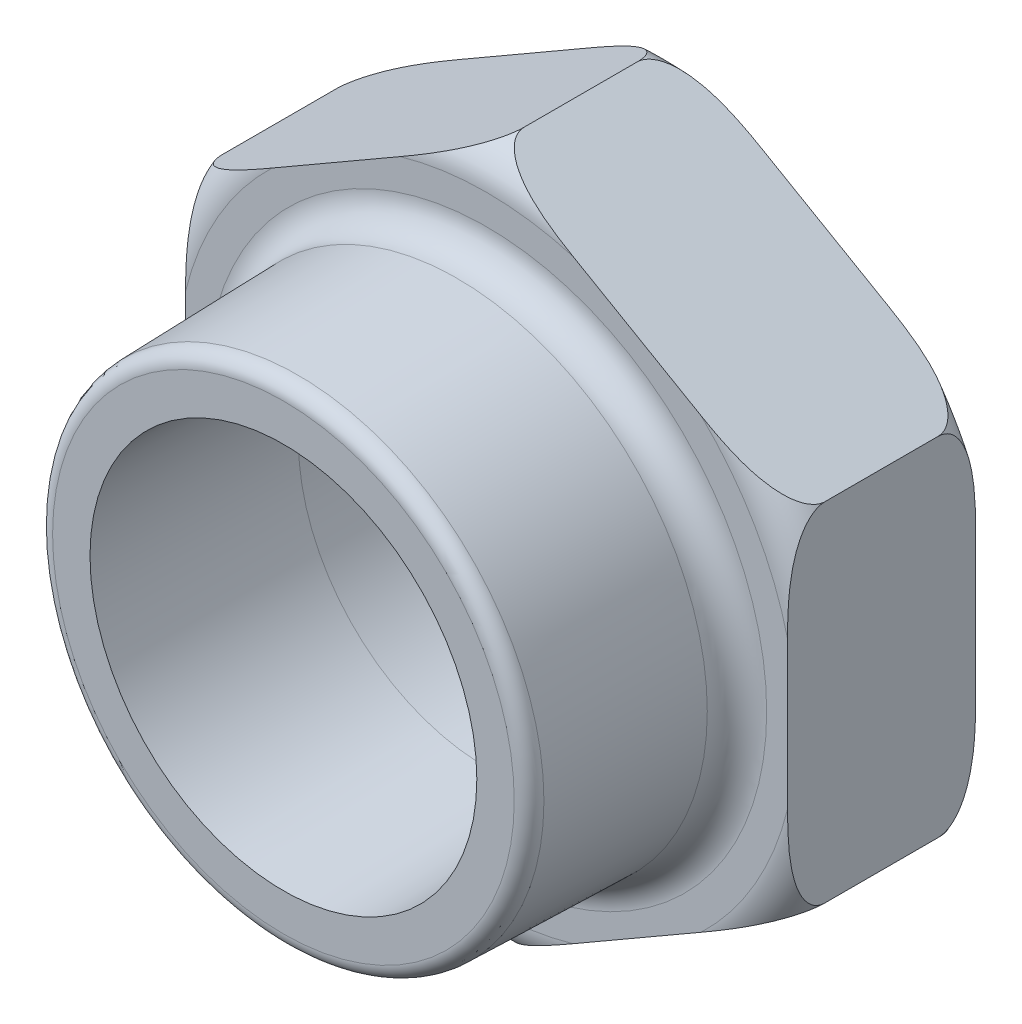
ISO-10303-21;
HEADER;
FILE_DESCRIPTION(('STEP AP214'),'2;1');
FILE_NAME('part.step','',(''),(''),'','','');
FILE_SCHEMA(('AUTOMOTIVE_DESIGN { 1 0 10303 214 1 1 1 1 }'));
ENDSEC;
DATA;
#1=APPLICATION_CONTEXT('core data for automotive mechanical design processes');
#2=APPLICATION_PROTOCOL_DEFINITION('international standard','automotive_design',2000,#1);
#3=PRODUCT_CONTEXT('',#1,'mechanical');
#4=PRODUCT('Part','Part','',(#3));
#5=PRODUCT_RELATED_PRODUCT_CATEGORY('part','',(#4));
#6=PRODUCT_DEFINITION_FORMATION('','',#4);
#7=PRODUCT_DEFINITION_CONTEXT('part definition',#1,'design');
#8=PRODUCT_DEFINITION('design','',#6,#7);
#9=PRODUCT_DEFINITION_SHAPE('','',#8);
#10=(LENGTH_UNIT() NAMED_UNIT(*) SI_UNIT(.MILLI.,.METRE.));
#11=(NAMED_UNIT(*) PLANE_ANGLE_UNIT() SI_UNIT($,.RADIAN.));
#12=(NAMED_UNIT(*) SI_UNIT($,.STERADIAN.) SOLID_ANGLE_UNIT());
#13=UNCERTAINTY_MEASURE_WITH_UNIT(LENGTH_MEASURE(1.E-05),#10,'distance_accuracy_value','');
#14=(GEOMETRIC_REPRESENTATION_CONTEXT(3) GLOBAL_UNCERTAINTY_ASSIGNED_CONTEXT((#13)) GLOBAL_UNIT_ASSIGNED_CONTEXT((#10,
#11,#12)) REPRESENTATION_CONTEXT('',''));
#15=CARTESIAN_POINT('',(0.,0.,0.));
#16=DIRECTION('',(0.,0.,1.));
#17=DIRECTION('',(1.,0.,0.));
#18=AXIS2_PLACEMENT_3D('',#15,#16,#17);
#19=CARTESIAN_POINT('',(-4.,6.92820323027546,2.5));
#20=DIRECTION('',(0.,0.,1.));
#21=DIRECTION('',(1.,0.,0.));
#22=AXIS2_PLACEMENT_3D('',#19,#20,#21);
#23=PLANE('',#22);
#24=CARTESIAN_POINT('',(0.,0.,2.5));
#25=DIRECTION('',(0.,0.,1.));
#26=DIRECTION('',(1.,0.,0.));
#27=AXIS2_PLACEMENT_3D('',#24,#25,#26);
#28=CIRCLE('',#27,3.72299608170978);
#29=CARTESIAN_POINT('',(3.72299608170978,0.,2.5));
#30=VERTEX_POINT('',#29);
#31=EDGE_CURVE('E219',#30,#30,#28,.F.);
#32=ORIENTED_EDGE('',*,*,#31,.T.);
#33=EDGE_LOOP('',(#32));
#34=FACE_BOUND('',#33,.T.);
#35=CARTESIAN_POINT('',(0.,0.,2.5));
#36=DIRECTION('',(0.,0.,1.));
#37=DIRECTION('',(1.,0.,0.));
#38=AXIS2_PLACEMENT_3D('',#35,#36,#37);
#39=CIRCLE('',#38,4.11880215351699);
#40=CARTESIAN_POINT('',(4.,-0.982105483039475,2.5));
#41=VERTEX_POINT('',#40);
#42=CARTESIAN_POINT('',(2.85052829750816,-2.97304887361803,2.5));
#43=VERTEX_POINT('',#42);
#44=EDGE_CURVE('E215',#41,#43,#39,.F.);
#45=ORIENTED_EDGE('',*,*,#44,.F.);
#46=DIRECTION('',(0.,-1.,0.));
#47=VECTOR('',#46,1.);
#48=CARTESIAN_POINT('',(4.,2.30940107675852,2.5));
#49=LINE('',#48,#47);
#50=CARTESIAN_POINT('',(4.,0.982105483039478,2.5));
#51=VERTEX_POINT('',#50);
#52=EDGE_CURVE('E194',#51,#41,#49,.T.);
#53=ORIENTED_EDGE('',*,*,#52,.F.);
#54=CARTESIAN_POINT('',(2.85052829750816,2.97304887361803,2.5));
#55=VERTEX_POINT('',#54);
#56=EDGE_CURVE('E213',#55,#51,#39,.F.);
#57=ORIENTED_EDGE('',*,*,#56,.F.);
#58=DIRECTION('',(-0.866025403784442,0.499999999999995,0.));
#59=VECTOR('',#58,1.);
#60=CARTESIAN_POINT('',(4.,2.30940107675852,2.5));
#61=LINE('',#60,#59);
#62=CARTESIAN_POINT('',(1.14947170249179,3.9551543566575,2.5));
#63=VERTEX_POINT('',#62);
#64=EDGE_CURVE('E181',#55,#63,#61,.T.);
#65=ORIENTED_EDGE('',*,*,#64,.T.);
#66=CARTESIAN_POINT('',(-1.1494717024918,3.9551543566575,2.5));
#67=VERTEX_POINT('',#66);
#68=EDGE_CURVE('E179',#67,#63,#39,.F.);
#69=ORIENTED_EDGE('',*,*,#68,.F.);
#70=DIRECTION('',(0.866025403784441,0.499999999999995,0.));
#71=VECTOR('',#70,1.);
#72=CARTESIAN_POINT('',(-4.,2.30940107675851,2.5));
#73=LINE('',#72,#71);
#74=CARTESIAN_POINT('',(-2.85052829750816,2.97304887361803,2.5));
#75=VERTEX_POINT('',#74);
#76=EDGE_CURVE('E172',#75,#67,#73,.T.);
#77=ORIENTED_EDGE('',*,*,#76,.F.);
#78=CARTESIAN_POINT('',(0.,0.,2.5));
#79=DIRECTION('',(0.,0.,-1.));
#80=DIRECTION('',(-1.,0.,0.));
#81=AXIS2_PLACEMENT_3D('',#78,#79,#80);
#82=CIRCLE('',#81,4.11880215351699);
#83=CARTESIAN_POINT('',(-4.,0.982105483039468,2.5));
#84=VERTEX_POINT('',#83);
#85=EDGE_CURVE('E155',#84,#75,#82,.T.);
#86=ORIENTED_EDGE('',*,*,#85,.F.);
#87=DIRECTION('',(0.,-1.,0.));
#88=VECTOR('',#87,1.);
#89=CARTESIAN_POINT('',(-4.,2.30940107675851,2.5));
#90=LINE('',#89,#88);
#91=CARTESIAN_POINT('',(-4.,-0.982105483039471,2.5));
#92=VERTEX_POINT('',#91);
#93=EDGE_CURVE('E180',#84,#92,#90,.T.);
#94=ORIENTED_EDGE('',*,*,#93,.T.);
#95=CARTESIAN_POINT('',(-2.85052829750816,-2.97304887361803,2.5));
#96=VERTEX_POINT('',#95);
#97=EDGE_CURVE('E437',#96,#92,#39,.F.);
#98=ORIENTED_EDGE('',*,*,#97,.F.);
#99=DIRECTION('',(0.866025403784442,-0.499999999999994,0.));
#100=VECTOR('',#99,1.);
#101=CARTESIAN_POINT('',(-4.,-2.30940107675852,2.5));
#102=LINE('',#101,#100);
#103=CARTESIAN_POINT('',(-1.1494717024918,-3.9551543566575,2.5));
#104=VERTEX_POINT('',#103);
#105=EDGE_CURVE('E183',#96,#104,#102,.T.);
#106=ORIENTED_EDGE('',*,*,#105,.T.);
#107=CARTESIAN_POINT('',(1.14947170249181,-3.9551543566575,2.5));
#108=VERTEX_POINT('',#107);
#109=EDGE_CURVE('E438',#108,#104,#39,.F.);
#110=ORIENTED_EDGE('',*,*,#109,.F.);
#111=DIRECTION('',(-0.866025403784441,-0.499999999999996,0.));
#112=VECTOR('',#111,1.);
#113=CARTESIAN_POINT('',(4.,-2.30940107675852,2.5));
#114=LINE('',#113,#112);
#115=EDGE_CURVE('E191',#43,#108,#114,.T.);
#116=ORIENTED_EDGE('',*,*,#115,.F.);
#117=EDGE_LOOP('',(#45,#53,#57,#65,#69,#77,#86,#94,#98,#106,#110,#116));
#118=FACE_BOUND('',#117,.T.);
#119=ADVANCED_FACE('F30',(#34,#118),#23,.T.);
#120=CARTESIAN_POINT('',(4.,2.30940107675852,2.5));
#121=DIRECTION('',(-0.499999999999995,-0.866025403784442,0.));
#122=DIRECTION('',(0.866025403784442,-0.499999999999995,0.));
#123=AXIS2_PLACEMENT_3D('',#120,#121,#122);
#124=PLANE('',#123);
#125=DIRECTION('',(0.,0.,-1.));
#126=VECTOR('',#125,1.);
#127=CARTESIAN_POINT('',(0.,4.61880215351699,2.5));
#128=LINE('',#127,#126);
#129=CARTESIAN_POINT('',(0.,4.61880215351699,2.));
#130=VERTEX_POINT('',#129);
#131=CARTESIAN_POINT('',(0.,4.61880215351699,0.5));
#132=VERTEX_POINT('',#131);
#133=EDGE_CURVE('E206',#130,#132,#128,.T.);
#134=ORIENTED_EDGE('',*,*,#133,.F.);
#135=CARTESIAN_POINT('',(6.92820272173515E-08,4.61880211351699,1.99980000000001));
#136=CARTESIAN_POINT('',(-4.12916663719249E-05,4.61882599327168,2.01480448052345));
#137=CARTESIAN_POINT('',(0.00114725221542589,4.61813978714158,2.02977136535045));
#138=CARTESIAN_POINT('',(0.00571479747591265,4.6155027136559,2.05912710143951));
#139=CARTESIAN_POINT('',(0.00907504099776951,4.61356267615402,2.07351979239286));
#140=CARTESIAN_POINT('',(0.01771195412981,4.60857615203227,2.10145209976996));
#141=CARTESIAN_POINT('',(0.0229830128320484,4.60553290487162,2.11499407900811));
#142=CARTESIAN_POINT('',(0.0351038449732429,4.59853493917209,2.1411190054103));
#143=CARTESIAN_POINT('',(0.0419569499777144,4.59457829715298,2.15369985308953));
#144=CARTESIAN_POINT('',(0.0619735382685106,4.58302171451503,2.18597543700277));
#145=CARTESIAN_POINT('',(0.0762714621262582,4.5747668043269,2.20473111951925));
#146=CARTESIAN_POINT('',(0.107196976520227,4.55691195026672,2.23948970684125));
#147=CARTESIAN_POINT('',(0.123832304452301,4.54730753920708,2.25548305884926));
#148=CARTESIAN_POINT('',(0.171601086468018,4.51972822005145,2.2960871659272));
#149=CARTESIAN_POINT('',(0.204294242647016,4.50085281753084,2.31822879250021));
#150=CARTESIAN_POINT('',(0.271933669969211,4.46180117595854,2.35690764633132));
#151=CARTESIAN_POINT('',(0.30688020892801,4.44162478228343,2.3734442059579));
#152=CARTESIAN_POINT('',(0.390460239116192,4.39336982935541,2.40733537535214));
#153=CARTESIAN_POINT('',(0.439611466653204,4.36499235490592,2.42295882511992));
#154=CARTESIAN_POINT('',(0.539010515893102,4.30760428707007,2.44874567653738));
#155=CARTESIAN_POINT('',(0.589260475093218,4.27859245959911,2.45889722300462));
#156=CARTESIAN_POINT('',(0.690881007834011,4.21992181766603,2.47528980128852));
#157=CARTESIAN_POINT('',(0.742257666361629,4.19025949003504,2.48147849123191));
#158=CARTESIAN_POINT('',(0.845115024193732,4.13087476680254,2.49085819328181));
#159=CARTESIAN_POINT('',(0.8965954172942,4.101152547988,2.4940540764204));
#160=CARTESIAN_POINT('',(1.00493871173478,4.03860051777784,2.49856274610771));
#161=CARTESIAN_POINT('',(1.06180797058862,4.00576703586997,2.49964675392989));
#162=CARTESIAN_POINT('',(1.17555518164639,3.94009505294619,2.5002045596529));
#163=CARTESIAN_POINT('',(1.23243313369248,3.90725655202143,2.49967808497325));
#164=CARTESIAN_POINT('',(1.34621957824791,3.84156191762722,2.49779915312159));
#165=CARTESIAN_POINT('',(1.40312806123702,3.80870578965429,2.49644607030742));
#166=CARTESIAN_POINT('',(1.51694181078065,3.74299539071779,2.49356350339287));
#167=CARTESIAN_POINT('',(1.57384707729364,3.71014111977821,2.49203401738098));
#168=CARTESIAN_POINT('',(1.68812166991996,3.64416465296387,2.48929403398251));
#169=CARTESIAN_POINT('',(1.74549104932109,3.61104242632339,2.48808619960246));
#170=CARTESIAN_POINT('',(1.86023850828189,3.54479295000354,2.4863508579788));
#171=CARTESIAN_POINT('',(1.91761658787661,3.51166570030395,2.48582335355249));
#172=CARTESIAN_POINT('',(2.03230304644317,3.44545144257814,2.48558977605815));
#173=CARTESIAN_POINT('',(2.08961142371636,3.41236443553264,2.48588268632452));
#174=CARTESIAN_POINT('',(2.20422065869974,3.34619476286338,2.48721029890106));
#175=CARTESIAN_POINT('',(2.26152151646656,3.31311209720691,2.48824499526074));
#176=CARTESIAN_POINT('',(2.37457846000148,3.24783864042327,2.49073494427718));
#177=CARTESIAN_POINT('',(2.43033476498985,3.21564772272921,2.49217817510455));
#178=CARTESIAN_POINT('',(2.54184658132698,3.15126634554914,2.49506384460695));
#179=CARTESIAN_POINT('',(2.59760209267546,3.1190758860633,2.49650628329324));
#180=CARTESIAN_POINT('',(2.70934501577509,3.05456107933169,2.49882611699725));
#181=CARTESIAN_POINT('',(2.7653324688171,3.02223670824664,2.49970124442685));
#182=CARTESIAN_POINT('',(2.8773103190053,2.95758626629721,2.5001735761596));
#183=CARTESIAN_POINT('',(2.93330071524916,2.92526019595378,2.49977091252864));
#184=CARTESIAN_POINT('',(3.04424567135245,2.86120609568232,2.49686919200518));
#185=CARTESIAN_POINT('',(3.09920083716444,2.82947771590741,2.4944077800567));
#186=CARTESIAN_POINT('',(3.2089392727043,2.76612020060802,2.48645986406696));
#187=CARTESIAN_POINT('',(3.26372261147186,2.73449102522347,2.48097479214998));
#188=CARTESIAN_POINT('',(3.37251998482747,2.67167683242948,2.4657740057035));
#189=CARTESIAN_POINT('',(3.42653668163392,2.64049027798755,2.4560846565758));
#190=CARTESIAN_POINT('',(3.53350363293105,2.57873287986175,2.43081512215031));
#191=CARTESIAN_POINT('',(3.58645604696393,2.54816078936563,2.41524848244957));
#192=CARTESIAN_POINT('',(3.65067725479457,2.51108265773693,2.39071571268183));
#193=CARTESIAN_POINT('',(3.66308769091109,2.5039174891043,2.38570363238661));
#194=CARTESIAN_POINT('',(3.68774535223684,2.48968138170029,2.3751308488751));
#195=CARTESIAN_POINT('',(3.69999240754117,2.48261054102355,2.36956961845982));
#196=CARTESIAN_POINT('',(3.73643130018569,2.46157253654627,2.35198402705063));
#197=CARTESIAN_POINT('',(3.7603091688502,2.44778664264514,2.33906210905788));
#198=CARTESIAN_POINT('',(3.80692094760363,2.42087531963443,2.31021338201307));
#199=CARTESIAN_POINT('',(3.82964453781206,2.40775584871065,2.29426402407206));
#200=CARTESIAN_POINT('',(3.8729178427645,2.38277199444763,2.25877969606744));
#201=CARTESIAN_POINT('',(3.89347176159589,2.37090518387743,2.23925186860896));
#202=CARTESIAN_POINT('',(3.92310792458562,2.35379473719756,2.20503694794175));
#203=CARTESIAN_POINT('',(3.93339149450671,2.34785751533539,2.19174357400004));
#204=CARTESIAN_POINT('',(3.95230469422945,2.33693797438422,2.16364433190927));
#205=CARTESIAN_POINT('',(3.96093452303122,2.33195554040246,2.14883864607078));
#206=CARTESIAN_POINT('',(3.97609223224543,2.32320423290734,2.11757840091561));
#207=CARTESIAN_POINT('',(3.98259163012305,2.31945180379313,2.10110507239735));
#208=CARTESIAN_POINT('',(3.99269463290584,2.31361883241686,2.0670261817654));
#209=CARTESIAN_POINT('',(3.99630818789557,2.31153254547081,2.04942473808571));
#210=CARTESIAN_POINT('',(3.99884695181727,2.31006678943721,2.02633615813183));
#211=CARTESIAN_POINT('',(3.99928191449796,2.30981566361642,2.0210411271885));
#212=CARTESIAN_POINT('',(3.99985997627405,2.30948191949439,2.01043163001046));
#213=CARTESIAN_POINT('',(4.0000031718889,2.30939924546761,2.00511717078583));
#214=CARTESIAN_POINT('',(3.99999993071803,2.30940111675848,1.99980000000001));
#215=B_SPLINE_CURVE_WITH_KNOTS('',3,(#135,#136,#137,#138,#139,#140,#141,#142,#143,#144,#145,
#146,#147,#148,#149,#150,#151,#152,#153,#154,#155,#156,#157,#158,#159,#160,#161,#162,#163,#164,
#165,#166,#167,#168,#169,#170,#171,#172,#173,#174,#175,#176,#177,#178,#179,#180,#181,#182,#183,
#184,#185,#186,#187,#188,#189,#190,#191,#192,#193,#194,#195,#196,#197,#198,#199,#200,#201,#202,
#203,#204,#205,#206,#207,#208,#209,#210,#211,#212,#213,#214),.UNSPECIFIED.,.F.,.F.,(4,2,2,2,2,2,
2,2,2,2,2,2,2,2,2,2,2,2,2,2,2,2,2,2,2,2,2,2,2,2,2,2,2,2,2,2,2,2,2,4),(0.,0.0448882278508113,
0.0893938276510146,0.133769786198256,0.178240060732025,0.252767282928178,0.32754729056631,
0.45809922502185,0.588666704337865,0.764832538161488,0.941378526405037,1.12021071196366,
1.29875132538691,1.49574584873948,1.69277371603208,1.88995089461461,2.08713021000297,
2.28589454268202,2.48465969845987,2.68317865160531,2.88169601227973,3.0748898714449,
3.26808091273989,3.46203946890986,3.65597797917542,3.84644586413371,4.03682361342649,
4.22602436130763,4.41479168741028,4.46032684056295,4.50590614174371,4.5971071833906,
4.68901623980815,4.78074380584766,4.83408801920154,4.88742580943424,4.94145008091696,
4.99528726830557,5.01123574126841,5.0271789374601),.UNSPECIFIED.);
#216=EDGE_CURVE('E378',#130,#63,#215,.T.);
#217=ORIENTED_EDGE('',*,*,#216,.T.);
#218=ORIENTED_EDGE('',*,*,#64,.F.);
#219=CARTESIAN_POINT('',(4.,2.30940107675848,2.));
#220=VERTEX_POINT('',#219);
#221=EDGE_CURVE('E293',#55,#220,#215,.T.);
#222=ORIENTED_EDGE('',*,*,#221,.T.);
#223=DIRECTION('',(0.,0.,-1.));
#224=VECTOR('',#223,1.);
#225=CARTESIAN_POINT('',(4.,2.30940107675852,2.5));
#226=LINE('',#225,#224);
#227=CARTESIAN_POINT('',(4.,2.30940107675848,0.5));
#228=VERTEX_POINT('',#227);
#229=EDGE_CURVE('E197',#220,#228,#226,.T.);
#230=ORIENTED_EDGE('',*,*,#229,.T.);
#231=CARTESIAN_POINT('',(3.99999993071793,2.30940111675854,0.5002));
#232=CARTESIAN_POINT('',(4.00004129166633,2.30937723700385,0.485195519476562));
#233=CARTESIAN_POINT('',(3.99885274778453,2.31006344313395,0.470228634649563));
#234=CARTESIAN_POINT('',(3.99428520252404,2.31270051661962,0.440872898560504));
#235=CARTESIAN_POINT('',(3.99092495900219,2.31464055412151,0.426480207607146));
#236=CARTESIAN_POINT('',(3.98228804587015,2.31962707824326,0.398547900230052));
#237=CARTESIAN_POINT('',(3.97701698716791,2.32267032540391,0.3850059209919));
#238=CARTESIAN_POINT('',(3.96489615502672,2.32966829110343,0.35888099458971));
#239=CARTESIAN_POINT('',(3.95804305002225,2.33362493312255,0.346300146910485));
#240=CARTESIAN_POINT('',(3.93802646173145,2.3451815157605,0.314024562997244));
#241=CARTESIAN_POINT('',(3.9237285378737,2.35343642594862,0.295268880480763));
#242=CARTESIAN_POINT('',(3.89280302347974,2.3712912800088,0.260510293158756));
#243=CARTESIAN_POINT('',(3.87616769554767,2.38089569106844,0.244516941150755));
#244=CARTESIAN_POINT('',(3.82839891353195,2.40847501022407,0.203912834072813));
#245=CARTESIAN_POINT('',(3.79570575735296,2.42735041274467,0.181771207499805));
#246=CARTESIAN_POINT('',(3.72806633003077,2.46640205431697,0.143092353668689));
#247=CARTESIAN_POINT('',(3.69311979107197,2.48657844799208,0.126555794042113));
#248=CARTESIAN_POINT('',(3.6095397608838,2.5348334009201,0.0926646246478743));
#249=CARTESIAN_POINT('',(3.5603885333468,2.56321087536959,0.0770411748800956));
#250=CARTESIAN_POINT('',(3.46098948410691,2.62059894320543,0.0512543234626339));
#251=CARTESIAN_POINT('',(3.4107395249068,2.64961077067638,0.0411027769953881));
#252=CARTESIAN_POINT('',(3.30911899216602,2.70828141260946,0.0247101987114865));
#253=CARTESIAN_POINT('',(3.25774233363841,2.73794374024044,0.0185215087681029));
#254=CARTESIAN_POINT('',(3.15488497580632,2.79732846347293,0.00914180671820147));
#255=CARTESIAN_POINT('',(3.10340458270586,2.82705068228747,0.00594592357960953));
#256=CARTESIAN_POINT('',(2.9950612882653,2.88960271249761,0.00143725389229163));
#257=CARTESIAN_POINT('',(2.93819202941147,2.92243619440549,0.000353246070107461));
#258=CARTESIAN_POINT('',(2.82444481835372,2.98810817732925,-0.000204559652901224));
#259=CARTESIAN_POINT('',(2.76756686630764,3.02094667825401,0.000321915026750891));
#260=CARTESIAN_POINT('',(2.65378042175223,3.0866413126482,0.00220084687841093));
#261=CARTESIAN_POINT('',(2.59687193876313,3.11949744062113,0.00355392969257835));
#262=CARTESIAN_POINT('',(2.48305818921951,3.18520783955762,0.00643649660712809));
#263=CARTESIAN_POINT('',(2.42615292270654,3.21806211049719,0.00796598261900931));
#264=CARTESIAN_POINT('',(2.31187833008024,3.28403857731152,0.0107059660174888));
#265=CARTESIAN_POINT('',(2.25450895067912,3.31716080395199,0.0119138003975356));
#266=CARTESIAN_POINT('',(2.13976149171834,3.38341028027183,0.0136491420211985));
#267=CARTESIAN_POINT('',(2.08238341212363,3.41653752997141,0.0141766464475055));
#268=CARTESIAN_POINT('',(1.96769695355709,3.48275178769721,0.0144102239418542));
#269=CARTESIAN_POINT('',(1.91038857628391,3.5158387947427,0.0141173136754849));
#270=CARTESIAN_POINT('',(1.79577934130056,3.58200846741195,0.0127897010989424));
#271=CARTESIAN_POINT('',(1.73847848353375,3.61509113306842,0.0117550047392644));
#272=CARTESIAN_POINT('',(1.62542153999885,3.68036458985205,0.00926505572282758));
#273=CARTESIAN_POINT('',(1.56966523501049,3.7125555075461,0.00782182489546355));
#274=CARTESIAN_POINT('',(1.45815341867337,3.77693688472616,0.00493615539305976));
#275=CARTESIAN_POINT('',(1.4023979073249,3.809127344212,0.00349371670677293));
#276=CARTESIAN_POINT('',(1.29065498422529,3.87364215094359,0.00117388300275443));
#277=CARTESIAN_POINT('',(1.23466753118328,3.90596652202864,0.000298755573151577));
#278=CARTESIAN_POINT('',(1.1226896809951,3.97061696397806,-0.000173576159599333));
#279=CARTESIAN_POINT('',(1.06669928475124,4.00294303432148,0.000229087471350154));
#280=CARTESIAN_POINT('',(0.955754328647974,4.06699713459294,0.0031308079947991));
#281=CARTESIAN_POINT('',(0.900799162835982,4.09872551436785,0.00559221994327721));
#282=CARTESIAN_POINT('',(0.791060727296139,4.16208302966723,0.0135401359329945));
#283=CARTESIAN_POINT('',(0.736277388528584,4.19371220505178,0.0190252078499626));
#284=CARTESIAN_POINT('',(0.627480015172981,4.25652639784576,0.034225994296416));
#285=CARTESIAN_POINT('',(0.573463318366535,4.2877129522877,0.0439153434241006));
#286=CARTESIAN_POINT('',(0.466496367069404,4.34947035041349,0.0691848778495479));
#287=CARTESIAN_POINT('',(0.413543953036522,4.38004244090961,0.0847515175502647));
#288=CARTESIAN_POINT('',(0.349322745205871,4.41712057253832,0.109284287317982));
#289=CARTESIAN_POINT('',(0.33691230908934,4.42428574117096,0.114296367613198));
#290=CARTESIAN_POINT('',(0.312254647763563,4.43852184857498,0.124869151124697));
#291=CARTESIAN_POINT('',(0.300007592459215,4.44559268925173,0.130430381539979));
#292=CARTESIAN_POINT('',(0.263568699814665,4.46663069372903,0.148015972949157));
#293=CARTESIAN_POINT('',(0.239690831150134,4.48041658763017,0.16093789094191));
#294=CARTESIAN_POINT('',(0.193079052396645,4.50732791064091,0.189786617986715));
#295=CARTESIAN_POINT('',(0.170355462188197,4.52044738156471,0.205735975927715));
#296=CARTESIAN_POINT('',(0.127082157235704,4.54543123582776,0.241220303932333));
#297=CARTESIAN_POINT('',(0.106528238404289,4.55729804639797,0.260748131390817));
#298=CARTESIAN_POINT('',(0.0768920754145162,4.57440849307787,0.294963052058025));
#299=CARTESIAN_POINT('',(0.0666085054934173,4.58034571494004,0.308256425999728));
#300=CARTESIAN_POINT('',(0.0476953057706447,4.59126525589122,0.336355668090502));
#301=CARTESIAN_POINT('',(0.0390654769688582,4.596247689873,0.35116135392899));
#302=CARTESIAN_POINT('',(0.0239077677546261,4.60499899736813,0.382421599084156));
#303=CARTESIAN_POINT('',(0.017408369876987,4.60875142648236,0.398894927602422));
#304=CARTESIAN_POINT('',(0.00730536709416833,4.61458439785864,0.432973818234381));
#305=CARTESIAN_POINT('',(0.00369181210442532,4.6166706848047,0.450575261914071));
#306=CARTESIAN_POINT('',(0.00115304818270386,4.61813644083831,0.47366384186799));
#307=CARTESIAN_POINT('',(0.000718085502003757,4.6183875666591,0.478958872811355));
#308=CARTESIAN_POINT('',(0.000140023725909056,4.61872131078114,0.489568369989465));
#309=CARTESIAN_POINT('',(-3.17188894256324E-06,4.61880398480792,0.494882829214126));
#310=CARTESIAN_POINT('',(6.9281927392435E-08,4.61880211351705,0.500199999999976));
#311=B_SPLINE_CURVE_WITH_KNOTS('',3,(#231,#232,#233,#234,#235,#236,#237,#238,#239,#240,#241,
#242,#243,#244,#245,#246,#247,#248,#249,#250,#251,#252,#253,#254,#255,#256,#257,#258,#259,#260,
#261,#262,#263,#264,#265,#266,#267,#268,#269,#270,#271,#272,#273,#274,#275,#276,#277,#278,#279,
#280,#281,#282,#283,#284,#285,#286,#287,#288,#289,#290,#291,#292,#293,#294,#295,#296,#297,#298,
#299,#300,#301,#302,#303,#304,#305,#306,#307,#308,#309,#310),.UNSPECIFIED.,.F.,.F.,(4,2,2,2,2,2,
2,2,2,2,2,2,2,2,2,2,2,2,2,2,2,2,2,2,2,2,2,2,2,2,2,2,2,2,2,2,2,2,2,4),(0.,0.0448882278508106,
0.0893938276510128,0.133769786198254,0.178240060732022,0.252767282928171,0.327547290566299,
0.458099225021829,0.588666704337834,0.764832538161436,0.941378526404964,1.12021071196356,
1.29875132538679,1.49574584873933,1.69277371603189,1.88995089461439,2.08713021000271,
2.28589454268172,2.48465969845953,2.68317865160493,2.88169601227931,3.07488987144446,
3.26808091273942,3.46203946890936,3.6559779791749,3.84644586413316,4.03682361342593,
4.22602436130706,4.41479168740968,4.46032684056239,4.50590614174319,4.59710718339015,
4.68901623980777,4.78074380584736,4.83408801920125,4.88742580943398,4.94145008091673,
4.99528726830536,5.01123574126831,5.02717893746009),.UNSPECIFIED.);
#312=CARTESIAN_POINT('',(2.85052829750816,2.97304887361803,0.));
#313=VERTEX_POINT('',#312);
#314=EDGE_CURVE('E371',#228,#313,#311,.T.);
#315=ORIENTED_EDGE('',*,*,#314,.T.);
#316=DIRECTION('',(-0.866025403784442,0.499999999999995,0.));
#317=VECTOR('',#316,1.);
#318=CARTESIAN_POINT('',(4.,2.30940107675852,0.));
#319=LINE('',#318,#317);
#320=CARTESIAN_POINT('',(1.14947170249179,3.9551543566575,0.));
#321=VERTEX_POINT('',#320);
#322=EDGE_CURVE('E340',#313,#321,#319,.T.);
#323=ORIENTED_EDGE('',*,*,#322,.T.);
#324=EDGE_CURVE('E344',#321,#132,#311,.T.);
#325=ORIENTED_EDGE('',*,*,#324,.T.);
#326=EDGE_LOOP('',(#134,#217,#218,#222,#230,#315,#323,#325));
#327=FACE_BOUND('',#326,.T.);
#328=ADVANCED_FACE('F32',(#327),#124,.F.);
#329=CARTESIAN_POINT('',(-4.,2.30940107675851,2.5));
#330=DIRECTION('',(-0.499999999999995,0.866025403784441,0.));
#331=DIRECTION('',(-0.866025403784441,-0.499999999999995,0.));
#332=AXIS2_PLACEMENT_3D('',#329,#330,#331);
#333=PLANE('',#332);
#334=CARTESIAN_POINT('',(-6.92820324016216E-08,4.61880211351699,1.99980000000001));
#335=CARTESIAN_POINT('',(4.12916663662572E-05,4.61882599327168,2.01480448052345));
#336=CARTESIAN_POINT('',(-0.00114725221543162,4.61813978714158,2.02977136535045));
#337=CARTESIAN_POINT('',(-0.00571479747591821,4.6155027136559,2.05912710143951));
#338=CARTESIAN_POINT('',(-0.00907504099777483,4.61356267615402,2.07351979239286));
#339=CARTESIAN_POINT('',(-0.0177119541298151,4.60857615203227,2.10145209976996));
#340=CARTESIAN_POINT('',(-0.0229830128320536,4.60553290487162,2.11499407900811));
#341=CARTESIAN_POINT('',(-0.0351038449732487,4.59853493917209,2.1411190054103));
#342=CARTESIAN_POINT('',(-0.0419569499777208,4.59457829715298,2.15369985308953));
#343=CARTESIAN_POINT('',(-0.0619735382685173,4.58302171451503,2.18597543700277));
#344=CARTESIAN_POINT('',(-0.0762714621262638,4.5747668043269,2.20473111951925));
#345=CARTESIAN_POINT('',(-0.107196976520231,4.55691195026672,2.23948970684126));
#346=CARTESIAN_POINT('',(-0.123832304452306,4.54730753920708,2.25548305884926));
#347=CARTESIAN_POINT('',(-0.171601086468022,4.51972822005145,2.2960871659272));
#348=CARTESIAN_POINT('',(-0.204294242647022,4.50085281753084,2.31822879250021));
#349=CARTESIAN_POINT('',(-0.271933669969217,4.46180117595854,2.35690764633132));
#350=CARTESIAN_POINT('',(-0.306880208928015,4.44162478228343,2.3734442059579));
#351=CARTESIAN_POINT('',(-0.390460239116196,4.39336982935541,2.40733537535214));
#352=CARTESIAN_POINT('',(-0.439611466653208,4.36499235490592,2.42295882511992));
#353=CARTESIAN_POINT('',(-0.539010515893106,4.30760428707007,2.44874567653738));
#354=CARTESIAN_POINT('',(-0.589260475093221,4.27859245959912,2.45889722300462));
#355=CARTESIAN_POINT('',(-0.690881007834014,4.21992181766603,2.47528980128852));
#356=CARTESIAN_POINT('',(-0.742257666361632,4.19025949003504,2.48147849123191));
#357=CARTESIAN_POINT('',(-0.845115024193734,4.13087476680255,2.49085819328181));
#358=CARTESIAN_POINT('',(-0.896595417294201,4.101152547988,2.4940540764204));
#359=CARTESIAN_POINT('',(-1.00493871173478,4.03860051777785,2.49856274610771));
#360=CARTESIAN_POINT('',(-1.06180797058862,4.00576703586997,2.49964675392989));
#361=CARTESIAN_POINT('',(-1.17555518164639,3.9400950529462,2.5002045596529));
#362=CARTESIAN_POINT('',(-1.23243313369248,3.90725655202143,2.49967808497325));
#363=CARTESIAN_POINT('',(-1.34621957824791,3.84156191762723,2.49779915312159));
#364=CARTESIAN_POINT('',(-1.40312806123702,3.80870578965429,2.49644607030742));
#365=CARTESIAN_POINT('',(-1.51694181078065,3.74299539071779,2.49356350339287));
#366=CARTESIAN_POINT('',(-1.57384707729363,3.71014111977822,2.49203401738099));
#367=CARTESIAN_POINT('',(-1.68812166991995,3.64416465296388,2.48929403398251));
#368=CARTESIAN_POINT('',(-1.74549104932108,3.61104242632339,2.48808619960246));
#369=CARTESIAN_POINT('',(-1.86023850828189,3.54479295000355,2.4863508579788));
#370=CARTESIAN_POINT('',(-1.91761658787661,3.51166570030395,2.48582335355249));
#371=CARTESIAN_POINT('',(-2.03230304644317,3.44545144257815,2.48558977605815));
#372=CARTESIAN_POINT('',(-2.08961142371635,3.41236443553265,2.48588268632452));
#373=CARTESIAN_POINT('',(-2.20422065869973,3.34619476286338,2.48721029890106));
#374=CARTESIAN_POINT('',(-2.26152151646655,3.31311209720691,2.48824499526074));
#375=CARTESIAN_POINT('',(-2.37457846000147,3.24783864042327,2.49073494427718));
#376=CARTESIAN_POINT('',(-2.43033476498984,3.21564772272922,2.49217817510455));
#377=CARTESIAN_POINT('',(-2.54184658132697,3.15126634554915,2.49506384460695));
#378=CARTESIAN_POINT('',(-2.59760209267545,3.1190758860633,2.49650628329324));
#379=CARTESIAN_POINT('',(-2.70934501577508,3.0545610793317,2.49882611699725));
#380=CARTESIAN_POINT('',(-2.7653324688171,3.02223670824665,2.49970124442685));
#381=CARTESIAN_POINT('',(-2.87731031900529,2.95758626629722,2.5001735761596));
#382=CARTESIAN_POINT('',(-2.93330071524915,2.92526019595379,2.49977091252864));
#383=CARTESIAN_POINT('',(-3.04424567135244,2.86120609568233,2.49686919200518));
#384=CARTESIAN_POINT('',(-3.09920083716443,2.82947771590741,2.4944077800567));
#385=CARTESIAN_POINT('',(-3.20893927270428,2.76612020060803,2.48645986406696));
#386=CARTESIAN_POINT('',(-3.26372261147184,2.73449102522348,2.48097479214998));
#387=CARTESIAN_POINT('',(-3.37251998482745,2.67167683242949,2.4657740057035));
#388=CARTESIAN_POINT('',(-3.4265366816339,2.64049027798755,2.4560846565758));
#389=CARTESIAN_POINT('',(-3.53350363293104,2.57873287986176,2.43081512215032));
#390=CARTESIAN_POINT('',(-3.58645604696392,2.54816078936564,2.41524848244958));
#391=CARTESIAN_POINT('',(-3.65067725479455,2.51108265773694,2.39071571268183));
#392=CARTESIAN_POINT('',(-3.66308769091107,2.5039174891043,2.38570363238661));
#393=CARTESIAN_POINT('',(-3.68774535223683,2.48968138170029,2.37513084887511));
#394=CARTESIAN_POINT('',(-3.69999240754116,2.48261054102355,2.36956961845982));
#395=CARTESIAN_POINT('',(-3.73643130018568,2.46157253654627,2.35198402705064));
#396=CARTESIAN_POINT('',(-3.76030916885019,2.44778664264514,2.33906210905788));
#397=CARTESIAN_POINT('',(-3.80692094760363,2.42087531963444,2.31021338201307));
#398=CARTESIAN_POINT('',(-3.82964453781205,2.40775584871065,2.29426402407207));
#399=CARTESIAN_POINT('',(-3.87291784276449,2.38277199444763,2.25877969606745));
#400=CARTESIAN_POINT('',(-3.89347176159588,2.37090518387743,2.23925186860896));
#401=CARTESIAN_POINT('',(-3.92310792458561,2.35379473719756,2.20503694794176));
#402=CARTESIAN_POINT('',(-3.9333914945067,2.34785751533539,2.19174357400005));
#403=CARTESIAN_POINT('',(-3.95230469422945,2.33693797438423,2.16364433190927));
#404=CARTESIAN_POINT('',(-3.96093452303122,2.33195554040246,2.14883864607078));
#405=CARTESIAN_POINT('',(-3.97609223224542,2.32320423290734,2.11757840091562));
#406=CARTESIAN_POINT('',(-3.98259163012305,2.31945180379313,2.10110507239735));
#407=CARTESIAN_POINT('',(-3.99269463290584,2.31361883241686,2.0670261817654));
#408=CARTESIAN_POINT('',(-3.99630818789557,2.31153254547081,2.04942473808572));
#409=CARTESIAN_POINT('',(-3.99884695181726,2.31006678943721,2.02633615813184));
#410=CARTESIAN_POINT('',(-3.99928191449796,2.30981566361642,2.0210411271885));
#411=CARTESIAN_POINT('',(-3.99985997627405,2.30948191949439,2.01043163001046));
#412=CARTESIAN_POINT('',(-4.0000031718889,2.30939924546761,2.00511717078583));
#413=CARTESIAN_POINT('',(-3.99999993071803,2.30940111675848,1.99980000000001));
#414=B_SPLINE_CURVE_WITH_KNOTS('',3,(#334,#335,#336,#337,#338,#339,#340,#341,#342,#343,#344,
#345,#346,#347,#348,#349,#350,#351,#352,#353,#354,#355,#356,#357,#358,#359,#360,#361,#362,#363,
#364,#365,#366,#367,#368,#369,#370,#371,#372,#373,#374,#375,#376,#377,#378,#379,#380,#381,#382,
#383,#384,#385,#386,#387,#388,#389,#390,#391,#392,#393,#394,#395,#396,#397,#398,#399,#400,#401,
#402,#403,#404,#405,#406,#407,#408,#409,#410,#411,#412,#413),.UNSPECIFIED.,.F.,.F.,(4,2,2,2,2,2,
2,2,2,2,2,2,2,2,2,2,2,2,2,2,2,2,2,2,2,2,2,2,2,2,2,2,2,2,2,2,2,2,2,4),(0.,0.0448882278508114,
0.0893938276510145,0.133769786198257,0.178240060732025,0.252767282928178,0.327547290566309,
0.458099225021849,0.588666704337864,0.764832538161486,0.941378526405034,1.12021071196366,
1.2987513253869,1.49574584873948,1.69277371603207,1.88995089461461,2.08713021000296,
2.28589454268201,2.48465969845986,2.68317865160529,2.88169601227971,3.07488987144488,
3.26808091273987,3.46203946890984,3.6559779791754,3.84644586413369,4.03682361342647,
4.22602436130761,4.41479168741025,4.46032684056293,4.50590614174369,4.59710718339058,
4.68901623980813,4.78074380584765,4.83408801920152,4.88742580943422,4.94145008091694,
4.99528726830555,5.0112357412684,5.02717893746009),.UNSPECIFIED.);
#415=EDGE_CURVE('E175',#130,#67,#414,.T.);
#416=ORIENTED_EDGE('',*,*,#415,.F.);
#417=ORIENTED_EDGE('',*,*,#133,.T.);
#418=CARTESIAN_POINT('',(-3.99999993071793,2.30940111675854,0.5002));
#419=CARTESIAN_POINT('',(-4.00004129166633,2.30937723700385,0.485195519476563));
#420=CARTESIAN_POINT('',(-3.99885274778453,2.31006344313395,0.470228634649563));
#421=CARTESIAN_POINT('',(-3.99428520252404,2.31270051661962,0.440872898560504));
#422=CARTESIAN_POINT('',(-3.99092495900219,2.31464055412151,0.426480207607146));
#423=CARTESIAN_POINT('',(-3.98228804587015,2.31962707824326,0.398547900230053));
#424=CARTESIAN_POINT('',(-3.97701698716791,2.32267032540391,0.385005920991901));
#425=CARTESIAN_POINT('',(-3.96489615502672,2.32966829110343,0.358880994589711));
#426=CARTESIAN_POINT('',(-3.95804305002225,2.33362493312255,0.346300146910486));
#427=CARTESIAN_POINT('',(-3.93802646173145,2.3451815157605,0.314024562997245));
#428=CARTESIAN_POINT('',(-3.92372853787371,2.35343642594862,0.295268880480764));
#429=CARTESIAN_POINT('',(-3.89280302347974,2.3712912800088,0.260510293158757));
#430=CARTESIAN_POINT('',(-3.87616769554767,2.38089569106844,0.244516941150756));
#431=CARTESIAN_POINT('',(-3.82839891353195,2.40847501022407,0.203912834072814));
#432=CARTESIAN_POINT('',(-3.79570575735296,2.42735041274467,0.181771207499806));
#433=CARTESIAN_POINT('',(-3.72806633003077,2.46640205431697,0.14309235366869));
#434=CARTESIAN_POINT('',(-3.69311979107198,2.48657844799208,0.126555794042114));
#435=CARTESIAN_POINT('',(-3.6095397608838,2.53483340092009,0.0926646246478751));
#436=CARTESIAN_POINT('',(-3.5603885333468,2.56321087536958,0.0770411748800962));
#437=CARTESIAN_POINT('',(-3.46098948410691,2.62059894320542,0.0512543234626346));
#438=CARTESIAN_POINT('',(-3.4107395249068,2.64961077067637,0.0411027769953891));
#439=CARTESIAN_POINT('',(-3.30911899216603,2.70828141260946,0.0247101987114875));
#440=CARTESIAN_POINT('',(-3.25774233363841,2.73794374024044,0.0185215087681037));
#441=CARTESIAN_POINT('',(-3.15488497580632,2.79732846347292,0.00914180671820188));
#442=CARTESIAN_POINT('',(-3.10340458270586,2.82705068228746,0.00594592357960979));
#443=CARTESIAN_POINT('',(-2.9950612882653,2.88960271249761,0.00143725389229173));
#444=CARTESIAN_POINT('',(-2.93819202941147,2.92243619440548,0.000353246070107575));
#445=CARTESIAN_POINT('',(-2.82444481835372,2.98810817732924,-0.000204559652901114));
#446=CARTESIAN_POINT('',(-2.76756686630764,3.020946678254,0.000321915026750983));
#447=CARTESIAN_POINT('',(-2.65378042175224,3.0866413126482,0.00220084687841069));
#448=CARTESIAN_POINT('',(-2.59687193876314,3.11949744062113,0.0035539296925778));
#449=CARTESIAN_POINT('',(-2.48305818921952,3.18520783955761,0.00643649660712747));
#450=CARTESIAN_POINT('',(-2.42615292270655,3.21806211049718,0.00796598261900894));
#451=CARTESIAN_POINT('',(-2.31187833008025,3.28403857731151,0.0107059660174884));
#452=CARTESIAN_POINT('',(-2.25450895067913,3.31716080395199,0.0119138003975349));
#453=CARTESIAN_POINT('',(-2.13976149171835,3.38341028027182,0.0136491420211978));
#454=CARTESIAN_POINT('',(-2.08238341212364,3.41653752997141,0.014176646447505));
#455=CARTESIAN_POINT('',(-1.96769695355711,3.4827517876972,0.0144102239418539));
#456=CARTESIAN_POINT('',(-1.91038857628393,3.51583879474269,0.0141173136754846));
#457=CARTESIAN_POINT('',(-1.79577934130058,3.58200846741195,0.0127897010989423));
#458=CARTESIAN_POINT('',(-1.73847848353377,3.61509113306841,0.0117550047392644));
#459=CARTESIAN_POINT('',(-1.62542153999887,3.68036458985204,0.00926505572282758));
#460=CARTESIAN_POINT('',(-1.5696652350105,3.71255550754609,0.00782182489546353));
#461=CARTESIAN_POINT('',(-1.45815341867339,3.77693688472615,0.00493615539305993));
#462=CARTESIAN_POINT('',(-1.40239790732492,3.80912734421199,0.0034937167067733));
#463=CARTESIAN_POINT('',(-1.29065498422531,3.87364215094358,0.00117388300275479));
#464=CARTESIAN_POINT('',(-1.2346675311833,3.90596652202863,0.000298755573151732));
#465=CARTESIAN_POINT('',(-1.12268968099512,3.97061696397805,-0.000173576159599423));
#466=CARTESIAN_POINT('',(-1.06669928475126,4.00294303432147,0.000229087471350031));
#467=CARTESIAN_POINT('',(-0.955754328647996,4.06699713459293,0.00313080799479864));
#468=CARTESIAN_POINT('',(-0.900799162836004,4.09872551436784,0.00559221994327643));
#469=CARTESIAN_POINT('',(-0.791060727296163,4.16208302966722,0.0135401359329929));
#470=CARTESIAN_POINT('',(-0.736277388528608,4.19371220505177,0.0190252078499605));
#471=CARTESIAN_POINT('',(-0.627480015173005,4.25652639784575,0.0342259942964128));
#472=CARTESIAN_POINT('',(-0.573463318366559,4.28771295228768,0.0439153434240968));
#473=CARTESIAN_POINT('',(-0.466496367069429,4.34947035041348,0.0691848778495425));
#474=CARTESIAN_POINT('',(-0.413543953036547,4.3800424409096,0.0847515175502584));
#475=CARTESIAN_POINT('',(-0.349322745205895,4.41712057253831,0.109284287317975));
#476=CARTESIAN_POINT('',(-0.336912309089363,4.42428574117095,0.114296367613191));
#477=CARTESIAN_POINT('',(-0.312254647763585,4.43852184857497,0.124869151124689));
#478=CARTESIAN_POINT('',(-0.300007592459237,4.44559268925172,0.130430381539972));
#479=CARTESIAN_POINT('',(-0.263568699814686,4.46663069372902,0.14801597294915));
#480=CARTESIAN_POINT('',(-0.239690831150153,4.48041658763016,0.160937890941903));
#481=CARTESIAN_POINT('',(-0.193079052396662,4.5073279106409,0.189786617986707));
#482=CARTESIAN_POINT('',(-0.170355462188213,4.5204473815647,0.205735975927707));
#483=CARTESIAN_POINT('',(-0.127082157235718,4.54543123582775,0.241220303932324));
#484=CARTESIAN_POINT('',(-0.106528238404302,4.55729804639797,0.260748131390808));
#485=CARTESIAN_POINT('',(-0.0768920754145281,4.57440849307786,0.294963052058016));
#486=CARTESIAN_POINT('',(-0.0666085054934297,4.58034571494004,0.308256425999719));
#487=CARTESIAN_POINT('',(-0.0476953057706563,4.59126525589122,0.336355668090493));
#488=CARTESIAN_POINT('',(-0.0390654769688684,4.59624768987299,0.35116135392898));
#489=CARTESIAN_POINT('',(-0.023907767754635,4.60499899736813,0.382421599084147));
#490=CARTESIAN_POINT('',(-0.017408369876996,4.60875142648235,0.398894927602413));
#491=CARTESIAN_POINT('',(-0.00730536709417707,4.61458439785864,0.432973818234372));
#492=CARTESIAN_POINT('',(-0.00369181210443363,4.6166706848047,0.450575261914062));
#493=CARTESIAN_POINT('',(-0.00115304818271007,4.61813644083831,0.473663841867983));
#494=CARTESIAN_POINT('',(-0.000718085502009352,4.6183875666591,0.478958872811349));
#495=CARTESIAN_POINT('',(-0.000140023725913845,4.61872131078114,0.489568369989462));
#496=CARTESIAN_POINT('',(3.17188893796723E-06,4.61880398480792,0.494882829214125));
#497=CARTESIAN_POINT('',(-6.92819322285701E-08,4.61880211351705,0.500199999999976));
#498=B_SPLINE_CURVE_WITH_KNOTS('',3,(#418,#419,#420,#421,#422,#423,#424,#425,#426,#427,#428,
#429,#430,#431,#432,#433,#434,#435,#436,#437,#438,#439,#440,#441,#442,#443,#444,#445,#446,#447,
#448,#449,#450,#451,#452,#453,#454,#455,#456,#457,#458,#459,#460,#461,#462,#463,#464,#465,#466,
#467,#468,#469,#470,#471,#472,#473,#474,#475,#476,#477,#478,#479,#480,#481,#482,#483,#484,#485,
#486,#487,#488,#489,#490,#491,#492,#493,#494,#495,#496,#497),.UNSPECIFIED.,.F.,.F.,(4,2,2,2,2,2,
2,2,2,2,2,2,2,2,2,2,2,2,2,2,2,2,2,2,2,2,2,2,2,2,2,2,2,2,2,2,2,2,2,4),(0.,0.0448882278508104,
0.0893938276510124,0.133769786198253,0.178240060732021,0.25276728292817,0.327547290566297,
0.458099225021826,0.588666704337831,0.764832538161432,0.94137852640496,1.12021071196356,
1.29875132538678,1.49574584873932,1.69277371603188,1.88995089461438,2.0871302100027,
2.28589454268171,2.48465969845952,2.68317865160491,2.88169601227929,3.07488987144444,
3.2680809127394,3.46203946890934,3.65597797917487,3.84644586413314,4.03682361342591,
4.22602436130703,4.41479168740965,4.46032684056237,4.50590614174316,4.59710718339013,
4.68901623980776,4.78074380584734,4.83408801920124,4.88742580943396,4.94145008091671,
4.99528726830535,5.01123574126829,5.02717893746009),.UNSPECIFIED.);
#499=CARTESIAN_POINT('',(-1.1494717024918,3.9551543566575,0.));
#500=VERTEX_POINT('',#499);
#501=EDGE_CURVE('E339',#500,#132,#498,.T.);
#502=ORIENTED_EDGE('',*,*,#501,.F.);
#503=DIRECTION('',(0.866025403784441,0.499999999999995,0.));
#504=VECTOR('',#503,1.);
#505=CARTESIAN_POINT('',(-4.,2.30940107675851,0.));
#506=LINE('',#505,#504);
#507=CARTESIAN_POINT('',(-2.85052829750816,2.97304887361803,0.));
#508=VERTEX_POINT('',#507);
#509=EDGE_CURVE('E343',#508,#500,#506,.T.);
#510=ORIENTED_EDGE('',*,*,#509,.F.);
#511=CARTESIAN_POINT('',(-4.,2.30940107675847,0.5));
#512=VERTEX_POINT('',#511);
#513=EDGE_CURVE('E334',#512,#508,#498,.T.);
#514=ORIENTED_EDGE('',*,*,#513,.F.);
#515=DIRECTION('',(0.,0.,-1.));
#516=VECTOR('',#515,1.);
#517=CARTESIAN_POINT('',(-4.,2.30940107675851,2.5));
#518=LINE('',#517,#516);
#519=CARTESIAN_POINT('',(-4.,2.30940107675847,2.));
#520=VERTEX_POINT('',#519);
#521=EDGE_CURVE('E174',#520,#512,#518,.T.);
#522=ORIENTED_EDGE('',*,*,#521,.F.);
#523=EDGE_CURVE('E158',#75,#520,#414,.T.);
#524=ORIENTED_EDGE('',*,*,#523,.F.);
#525=ORIENTED_EDGE('',*,*,#76,.T.);
#526=EDGE_LOOP('',(#416,#417,#502,#510,#514,#522,#524,#525));
#527=FACE_BOUND('',#526,.T.);
#528=ADVANCED_FACE('F171',(#527),#333,.T.);
#529=CARTESIAN_POINT('',(-4.,2.30940107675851,2.5));
#530=DIRECTION('',(1.,0.,0.));
#531=DIRECTION('',(0.,1.,0.));
#532=AXIS2_PLACEMENT_3D('',#529,#530,#531);
#533=PLANE('',#532);
#534=ORIENTED_EDGE('',*,*,#93,.F.);
#535=CARTESIAN_POINT('',(-4.,0.,2.48568101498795));
#536=CARTESIAN_POINT('',(-4.,0.0832237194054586,2.48568332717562));
#537=CARTESIAN_POINT('',(-4.,0.1664478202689,2.48633981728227));
#538=CARTESIAN_POINT('',(-4.,0.332887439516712,2.48869865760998));
#539=CARTESIAN_POINT('',(-4.,0.416102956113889,2.49040111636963));
#540=CARTESIAN_POINT('',(-4.,0.582762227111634,2.49408058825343));
#541=CARTESIAN_POINT('',(-4.,0.666205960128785,2.49605836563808));
#542=CARTESIAN_POINT('',(-4.,0.833098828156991,2.49909627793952));
#543=CARTESIAN_POINT('',(-4.,0.916547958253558,2.50015660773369));
#544=CARTESIAN_POINT('',(-4.,1.06866146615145,2.49983739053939));
#545=CARTESIAN_POINT('',(-4.,1.13732490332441,2.49885696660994));
#546=CARTESIAN_POINT('',(-4.,1.27455240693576,2.49414931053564));
#547=CARTESIAN_POINT('',(-4.,1.34311649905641,2.49042300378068));
#548=CARTESIAN_POINT('',(-4.,1.47971430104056,2.47889419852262));
#549=CARTESIAN_POINT('',(-4.,1.54774898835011,2.47110408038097));
#550=CARTESIAN_POINT('',(-4.,1.6828592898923,2.44967949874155));
#551=CARTESIAN_POINT('',(-4.,1.74993643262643,2.43605576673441));
#552=CARTESIAN_POINT('',(-4.,1.86465848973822,2.40496816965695));
#553=CARTESIAN_POINT('',(-4.,1.91281480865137,2.38942833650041));
#554=CARTESIAN_POINT('',(-4.,2.00663167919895,2.35208840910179));
#555=CARTESIAN_POINT('',(-4.,2.05230062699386,2.33031115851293));
#556=CARTESIAN_POINT('',(-4.,2.11588828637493,2.2918086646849));
#557=CARTESIAN_POINT('',(-4.,2.13581175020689,2.27841282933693));
#558=CARTESIAN_POINT('',(-4.,2.17393909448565,2.24930975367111));
#559=CARTESIAN_POINT('',(-4.,2.19214298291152,2.23360252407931));
#560=CARTESIAN_POINT('',(-4.,2.22334467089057,2.20221664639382));
#561=CARTESIAN_POINT('',(-4.,2.23671213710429,2.18691013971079));
#562=CARTESIAN_POINT('',(-4.,2.26082772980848,2.15434775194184));
#563=CARTESIAN_POINT('',(-4.,2.27158111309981,2.13709588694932));
#564=CARTESIAN_POINT('',(-4.,2.28725612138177,2.10540050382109));
#565=CARTESIAN_POINT('',(-4.,2.2929647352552,2.09134875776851));
#566=CARTESIAN_POINT('',(-4.,2.30198245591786,2.06249203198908));
#567=CARTESIAN_POINT('',(-4.,2.30529372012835,2.04768774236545));
#568=CARTESIAN_POINT('',(-4.,2.30923385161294,2.01764629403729));
#569=CARTESIAN_POINT('',(-4.,2.30984970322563,2.00240739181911));
#570=CARTESIAN_POINT('',(-4.,2.30830097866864,1.97207139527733));
#571=CARTESIAN_POINT('',(-4.,2.30613591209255,1.95697432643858));
#572=CARTESIAN_POINT('',(-4.,2.29946294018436,1.92836729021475));
#573=CARTESIAN_POINT('',(-4.,2.29511836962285,1.9148182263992));
#574=CARTESIAN_POINT('',(-4.,2.28449707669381,1.88850866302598));
#575=CARTESIAN_POINT('',(-4.,2.27821959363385,1.87574847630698));
#576=CARTESIAN_POINT('',(-4.,2.26032468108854,1.84462617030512));
#577=CARTESIAN_POINT('',(-4.,2.24764026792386,1.82687841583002));
#578=CARTESIAN_POINT('',(-4.,2.21964415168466,1.79359480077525));
#579=CARTESIAN_POINT('',(-4.,2.2043254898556,1.77806500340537));
#580=CARTESIAN_POINT('',(-4.,2.16138272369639,1.73965796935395));
#581=CARTESIAN_POINT('',(-4.,2.13220945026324,1.71852772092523));
#582=CARTESIAN_POINT('',(-4.,2.07113824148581,1.68072353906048));
#583=CARTESIAN_POINT('',(-4.,2.03923346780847,1.66406124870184));
#584=CARTESIAN_POINT('',(-4.,1.97373234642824,1.63423984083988));
#585=CARTESIAN_POINT('',(-4.,1.9401309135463,1.62109210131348));
#586=CARTESIAN_POINT('',(-4.,1.87193207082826,1.59765451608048));
#587=CARTESIAN_POINT('',(-4.,1.83733364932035,1.58736769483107));
#588=CARTESIAN_POINT('',(-4.,1.73257840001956,1.55995228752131));
#589=CARTESIAN_POINT('',(-4.,1.66152310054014,1.54629385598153));
#590=CARTESIAN_POINT('',(-4.,1.5068969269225,1.52346411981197));
#591=CARTESIAN_POINT('',(-4.,1.42318254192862,1.51539434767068));
#592=CARTESIAN_POINT('',(-4.,1.25535836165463,1.50458558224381));
#593=CARTESIAN_POINT('',(-4.,1.17124821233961,1.50185300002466));
#594=CARTESIAN_POINT('',(-4.,1.00288888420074,1.49952938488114));
#595=CARTESIAN_POINT('',(-4.,0.918639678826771,1.49994285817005));
#596=CARTESIAN_POINT('',(-4.,0.750220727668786,1.50219732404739));
#597=CARTESIAN_POINT('',(-4.,0.666050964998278,1.5040374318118));
#598=CARTESIAN_POINT('',(-4.,0.498352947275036,1.50778421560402));
#599=CARTESIAN_POINT('',(-4.,0.414824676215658,1.50969027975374));
#600=CARTESIAN_POINT('',(-4.,0.247753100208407,1.51265413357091));
#601=CARTESIAN_POINT('',(-4.,0.164209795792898,1.51371194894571));
#602=CARTESIAN_POINT('',(-4.,-0.00295581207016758,1.51452996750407));
#603=CARTESIAN_POINT('',(-4.,-0.0865781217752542,1.51428905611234));
#604=CARTESIAN_POINT('',(-4.,-0.253806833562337,1.51260693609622));
#605=CARTESIAN_POINT('',(-4.,-0.337413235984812,1.51116575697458));
#606=CARTESIAN_POINT('',(-4.,-0.504572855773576,1.50771770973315));
#607=CARTESIAN_POINT('',(-4.,-0.588126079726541,1.50571110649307));
#608=CARTESIAN_POINT('',(-4.,-0.755242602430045,1.50220772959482));
#609=CARTESIAN_POINT('',(-4.,-0.838805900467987,1.50071093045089));
#610=CARTESIAN_POINT('',(-4.,-1.00580684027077,1.49967267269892));
#611=CARTESIAN_POINT('',(-4.,-1.08924444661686,1.50012780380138));
#612=CARTESIAN_POINT('',(-4.,-1.2560043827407,1.50479205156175));
#613=CARTESIAN_POINT('',(-4.,-1.33932675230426,1.50899864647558));
#614=CARTESIAN_POINT('',(-4.,-1.46442166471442,1.51997269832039));
#615=CARTESIAN_POINT('',(-4.,-1.50639042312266,1.5244492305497));
#616=CARTESIAN_POINT('',(-4.,-1.59009261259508,1.53539776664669));
#617=CARTESIAN_POINT('',(-4.,-1.63182594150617,1.54187057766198));
#618=CARTESIAN_POINT('',(-4.,-1.71460505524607,1.55726874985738));
#619=CARTESIAN_POINT('',(-4.,-1.75565338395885,1.56618014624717));
#620=CARTESIAN_POINT('',(-4.,-1.83697206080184,1.58711124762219));
#621=CARTESIAN_POINT('',(-4.,-1.87724254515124,1.59913040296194));
#622=CARTESIAN_POINT('',(-4.,-1.94437560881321,1.62288676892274));
#623=CARTESIAN_POINT('',(-4.,-1.97159712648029,1.63360183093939));
#624=CARTESIAN_POINT('',(-4.,-2.02500683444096,1.65733937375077));
#625=CARTESIAN_POINT('',(-4.,-2.05119592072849,1.67035979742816));
#626=CARTESIAN_POINT('',(-4.,-2.10225461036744,1.6993230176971));
#627=CARTESIAN_POINT('',(-4.,-2.12710968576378,1.71529185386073));
#628=CARTESIAN_POINT('',(-4.,-2.17426293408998,1.75064753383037));
#629=CARTESIAN_POINT('',(-4.,-2.19656784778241,1.77002500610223));
#630=CARTESIAN_POINT('',(-4.,-2.229081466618,1.80435877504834));
#631=CARTESIAN_POINT('',(-4.,-2.24060189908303,1.81806551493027));
#632=CARTESIAN_POINT('',(-4.,-2.26157554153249,1.84700523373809));
#633=CARTESIAN_POINT('',(-4.,-2.27102909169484,1.86223796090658));
#634=CARTESIAN_POINT('',(-4.,-2.28730858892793,1.89432478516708));
#635=CARTESIAN_POINT('',(-4.,-2.29409957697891,1.91119704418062));
#636=CARTESIAN_POINT('',(-4.,-2.30415870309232,1.94595892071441));
#637=CARTESIAN_POINT('',(-4.,-2.30743369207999,1.96384648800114));
#638=CARTESIAN_POINT('',(-4.,-2.30986296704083,1.99727698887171));
#639=CARTESIAN_POINT('',(-4.,-2.30954733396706,2.01278251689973));
#640=CARTESIAN_POINT('',(-4.,-2.30608662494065,2.0434746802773));
#641=CARTESIAN_POINT('',(-4.,-2.3029407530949,2.05866122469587));
#642=CARTESIAN_POINT('',(-4.,-2.29444224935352,2.08717662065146));
#643=CARTESIAN_POINT('',(-4.,-2.28926812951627,2.10056006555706));
#644=CARTESIAN_POINT('',(-4.,-2.27709200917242,2.12645626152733));
#645=CARTESIAN_POINT('',(-4.,-2.27008956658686,2.13896880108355));
#646=CARTESIAN_POINT('',(-4.,-2.24980037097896,2.17049891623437));
#647=CARTESIAN_POINT('',(-4.,-2.23530886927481,2.18874060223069));
#648=CARTESIAN_POINT('',(-4.,-2.20366778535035,2.22275270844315));
#649=CARTESIAN_POINT('',(-4.,-2.18651040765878,2.23851559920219));
#650=CARTESIAN_POINT('',(-4.,-2.13787280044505,2.2780026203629));
#651=CARTESIAN_POINT('',(-4.,-2.10472210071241,2.2996511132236));
#652=CARTESIAN_POINT('',(-4.,-2.03570961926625,2.33797457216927));
#653=CARTESIAN_POINT('',(-4.,-1.9998414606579,2.35463735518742));
#654=CARTESIAN_POINT('',(-4.,-1.91669546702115,2.38806284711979));
#655=CARTESIAN_POINT('',(-4.,-1.8689490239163,2.40364093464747));
#656=CARTESIAN_POINT('',(-4.,-1.77216156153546,2.43018274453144));
#657=CARTESIAN_POINT('',(-4.,-1.72311829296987,2.44113780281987));
#658=CARTESIAN_POINT('',(-4.,-1.62422396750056,2.4595533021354));
#659=CARTESIAN_POINT('',(-4.,-1.57437070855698,2.46700156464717));
#660=CARTESIAN_POINT('',(-4.,-1.47432951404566,2.47918534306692));
#661=CARTESIAN_POINT('',(-4.,-1.42414145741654,2.48391981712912));
#662=CARTESIAN_POINT('',(-4.,-1.31675700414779,2.49182997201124));
#663=CARTESIAN_POINT('',(-4.,-1.2595394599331,2.49470450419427));
#664=CARTESIAN_POINT('',(-4.,-1.14503570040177,2.49854976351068));
#665=CARTESIAN_POINT('',(-4.,-1.08774947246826,2.49952005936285));
#666=CARTESIAN_POINT('',(-4.,-0.91618880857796,2.50054049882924));
#667=CARTESIAN_POINT('',(-4.,-0.801912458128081,2.49871514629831));
#668=CARTESIAN_POINT('',(-4.,-0.573032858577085,2.49402128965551));
#669=CARTESIAN_POINT('',(-4.,-0.458429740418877,2.49114944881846));
#670=CARTESIAN_POINT('',(-4.,-0.286512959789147,2.48800500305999));
#671=CARTESIAN_POINT('',(-4.,-0.229213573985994,2.48715077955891));
#672=CARTESIAN_POINT('',(-4.,-0.11460951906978,2.48598798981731));
#673=CARTESIAN_POINT('',(-4.,-0.0573048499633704,2.48567942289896));
#674=CARTESIAN_POINT('',(-4.,0.,2.48568101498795));
#675=B_SPLINE_CURVE_WITH_KNOTS('',3,(#535,#536,#537,#538,#539,#540,#541,#542,#543,#544,#545,
#546,#547,#548,#549,#550,#551,#552,#553,#554,#555,#556,#557,#558,#559,#560,#561,#562,#563,#564,
#565,#566,#567,#568,#569,#570,#571,#572,#573,#574,#575,#576,#577,#578,#579,#580,#581,#582,#583,
#584,#585,#586,#587,#588,#589,#590,#591,#592,#593,#594,#595,#596,#597,#598,#599,#600,#601,#602,
#603,#604,#605,#606,#607,#608,#609,#610,#611,#612,#613,#614,#615,#616,#617,#618,#619,#620,#621,
#622,#623,#624,#625,#626,#627,#628,#629,#630,#631,#632,#633,#634,#635,#636,#637,#638,#639,#640,
#641,#642,#643,#644,#645,#646,#647,#648,#649,#650,#651,#652,#653,#654,#655,#656,#657,#658,#659,
#660,#661,#662,#663,#664,#665,#666,#667,#668,#669,#670,#671,#672,#673,#674),.UNSPECIFIED.,.T.,
.F.,(4,2,2,2,2,2,2,2,2,2,2,2,2,2,2,2,2,2,2,2,2,2,2,2,2,2,2,2,2,2,2,2,2,2,2,2,2,2,2,2,2,2,2,2,2,
2,2,2,2,2,2,2,2,2,2,2,2,2,2,2,2,2,2,2,2,2,2,2,2,4),(0.,0.249670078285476,0.499366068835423,
0.749769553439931,1.00011983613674,1.20609942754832,1.41200963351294,1.61729616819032,
1.82220667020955,1.97375358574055,2.12475242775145,2.19665210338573,2.26855144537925,
2.32931819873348,2.38996172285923,2.43528284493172,2.48056313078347,2.52606182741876,
2.57156854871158,2.61408435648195,2.65661691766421,2.7216866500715,2.78693099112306,
2.89438774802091,3.00212186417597,3.11020064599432,3.21839325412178,3.43497594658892,
3.68703680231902,3.93940024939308,4.19212523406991,4.44469359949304,4.69534331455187,
4.94598543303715,5.19684268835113,5.44769377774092,5.69842754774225,5.94914878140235,
6.19943214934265,6.44954740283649,6.57613185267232,6.70276755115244,6.82869270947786,
6.95459561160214,7.04227608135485,7.12987870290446,7.2182956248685,7.30647315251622,
7.36004388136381,7.41360578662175,7.46784911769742,7.52198656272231,7.56824955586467,
7.61452556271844,7.65741206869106,7.70030895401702,7.76979805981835,7.83949432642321,
7.95760364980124,8.07599927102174,8.22632022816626,8.37692166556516,8.52804232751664,
8.67922096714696,8.85104394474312,9.02290583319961,9.36572975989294,9.70965648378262,
9.88157050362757,10.0534843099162),.UNSPECIFIED.);
#676=EDGE_CURVE('E160',#84,#520,#675,.T.);
#677=ORIENTED_EDGE('',*,*,#676,.T.);
#678=ORIENTED_EDGE('',*,*,#521,.T.);
#679=CARTESIAN_POINT('',(-4.,0.,0.0143189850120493));
#680=CARTESIAN_POINT('',(-4.,-0.0832237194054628,0.0143166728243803));
#681=CARTESIAN_POINT('',(-4.,-0.166447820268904,0.0136601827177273));
#682=CARTESIAN_POINT('',(-4.,-0.332887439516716,0.0113013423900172));
#683=CARTESIAN_POINT('',(-4.,-0.416102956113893,0.00959888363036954));
#684=CARTESIAN_POINT('',(-4.,-0.582762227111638,0.00591941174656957));
#685=CARTESIAN_POINT('',(-4.,-0.666205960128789,0.00394163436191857));
#686=CARTESIAN_POINT('',(-4.,-0.833098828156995,0.000903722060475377));
#687=CARTESIAN_POINT('',(-4.,-0.916547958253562,-0.000156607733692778));
#688=CARTESIAN_POINT('',(-4.,-1.06866146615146,0.000162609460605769));
#689=CARTESIAN_POINT('',(-4.,-1.13732490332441,0.0011430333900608));
#690=CARTESIAN_POINT('',(-4.,-1.27455240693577,0.00585068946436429));
#691=CARTESIAN_POINT('',(-4.,-1.34311649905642,0.00957699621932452));
#692=CARTESIAN_POINT('',(-4.,-1.47971430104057,0.0211058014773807));
#693=CARTESIAN_POINT('',(-4.,-1.54774898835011,0.0288959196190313));
#694=CARTESIAN_POINT('',(-4.,-1.6828592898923,0.0503205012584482));
#695=CARTESIAN_POINT('',(-4.,-1.74993643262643,0.0639442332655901));
#696=CARTESIAN_POINT('',(-4.,-1.86465848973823,0.0950318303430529));
#697=CARTESIAN_POINT('',(-4.,-1.91281480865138,0.11057166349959));
#698=CARTESIAN_POINT('',(-4.,-2.00663167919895,0.147911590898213));
#699=CARTESIAN_POINT('',(-4.,-2.05230062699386,0.169688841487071));
#700=CARTESIAN_POINT('',(-4.,-2.11588828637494,0.208191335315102));
#701=CARTESIAN_POINT('',(-4.,-2.1358117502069,0.221587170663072));
#702=CARTESIAN_POINT('',(-4.,-2.17393909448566,0.250690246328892));
#703=CARTESIAN_POINT('',(-4.,-2.19214298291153,0.26639747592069));
#704=CARTESIAN_POINT('',(-4.,-2.22334467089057,0.297783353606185));
#705=CARTESIAN_POINT('',(-4.,-2.23671213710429,0.313089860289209));
#706=CARTESIAN_POINT('',(-4.,-2.26082772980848,0.345652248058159));
#707=CARTESIAN_POINT('',(-4.,-2.27158111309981,0.362904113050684));
#708=CARTESIAN_POINT('',(-4.,-2.28725612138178,0.394599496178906));
#709=CARTESIAN_POINT('',(-4.,-2.2929647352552,0.408651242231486));
#710=CARTESIAN_POINT('',(-4.,-2.30198245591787,0.437507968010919));
#711=CARTESIAN_POINT('',(-4.,-2.30529372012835,0.452312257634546));
#712=CARTESIAN_POINT('',(-4.,-2.30923385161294,0.482353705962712));
#713=CARTESIAN_POINT('',(-4.,-2.30984970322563,0.497592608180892));
#714=CARTESIAN_POINT('',(-4.,-2.30830097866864,0.527928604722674));
#715=CARTESIAN_POINT('',(-4.,-2.30613591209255,0.54302567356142));
#716=CARTESIAN_POINT('',(-4.,-2.29946294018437,0.571632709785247));
#717=CARTESIAN_POINT('',(-4.,-2.29511836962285,0.585181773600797));
#718=CARTESIAN_POINT('',(-4.,-2.28449707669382,0.611491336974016));
#719=CARTESIAN_POINT('',(-4.,-2.27821959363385,0.624251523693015));
#720=CARTESIAN_POINT('',(-4.,-2.26032468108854,0.655373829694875));
#721=CARTESIAN_POINT('',(-4.,-2.24764026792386,0.673121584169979));
#722=CARTESIAN_POINT('',(-4.,-2.21964415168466,0.706405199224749));
#723=CARTESIAN_POINT('',(-4.,-2.2043254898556,0.721934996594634));
#724=CARTESIAN_POINT('',(-4.,-2.16138272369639,0.76034203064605));
#725=CARTESIAN_POINT('',(-4.,-2.13220945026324,0.781472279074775));
#726=CARTESIAN_POINT('',(-4.,-2.07113824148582,0.819276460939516));
#727=CARTESIAN_POINT('',(-4.,-2.03923346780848,0.83593875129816));
#728=CARTESIAN_POINT('',(-4.,-1.97373234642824,0.865760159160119));
#729=CARTESIAN_POINT('',(-4.,-1.9401309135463,0.878907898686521));
#730=CARTESIAN_POINT('',(-4.,-1.87193207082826,0.902345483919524));
#731=CARTESIAN_POINT('',(-4.,-1.83733364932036,0.912632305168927));
#732=CARTESIAN_POINT('',(-4.,-1.73257840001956,0.940047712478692));
#733=CARTESIAN_POINT('',(-4.,-1.66152310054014,0.953706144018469));
#734=CARTESIAN_POINT('',(-4.,-1.50689692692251,0.976535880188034));
#735=CARTESIAN_POINT('',(-4.,-1.42318254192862,0.984605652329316));
#736=CARTESIAN_POINT('',(-4.,-1.25535836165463,0.995414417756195));
#737=CARTESIAN_POINT('',(-4.,-1.17124821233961,0.998146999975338));
#738=CARTESIAN_POINT('',(-4.,-1.00288888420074,1.00047061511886));
#739=CARTESIAN_POINT('',(-4.,-0.91863967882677,1.00005714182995));
#740=CARTESIAN_POINT('',(-4.,-0.750220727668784,0.997802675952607));
#741=CARTESIAN_POINT('',(-4.,-0.666050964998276,0.995962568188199));
#742=CARTESIAN_POINT('',(-4.,-0.49835294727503,0.992215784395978));
#743=CARTESIAN_POINT('',(-4.,-0.41482467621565,0.990309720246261));
#744=CARTESIAN_POINT('',(-4.,-0.247753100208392,0.987345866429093));
#745=CARTESIAN_POINT('',(-4.,-0.164209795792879,0.986288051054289));
#746=CARTESIAN_POINT('',(-4.,0.00295581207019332,0.985470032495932));
#747=CARTESIAN_POINT('',(-4.,0.0865781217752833,0.985710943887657));
#748=CARTESIAN_POINT('',(-4.,0.253806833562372,0.987393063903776));
#749=CARTESIAN_POINT('',(-4.,0.337413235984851,0.988834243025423));
#750=CARTESIAN_POINT('',(-4.,0.504572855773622,0.992282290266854));
#751=CARTESIAN_POINT('',(-4.,0.58812607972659,0.994288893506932));
#752=CARTESIAN_POINT('',(-4.,0.755242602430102,0.997792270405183));
#753=CARTESIAN_POINT('',(-4.,0.838805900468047,0.999289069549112));
#754=CARTESIAN_POINT('',(-4.,1.00580684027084,1.00032732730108));
#755=CARTESIAN_POINT('',(-4.,1.08924444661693,0.999872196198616));
#756=CARTESIAN_POINT('',(-4.,1.25600438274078,0.995207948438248));
#757=CARTESIAN_POINT('',(-4.,1.33932675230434,0.991001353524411));
#758=CARTESIAN_POINT('',(-4.,1.46442166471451,0.980027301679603));
#759=CARTESIAN_POINT('',(-4.,1.50639042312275,0.975550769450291));
#760=CARTESIAN_POINT('',(-4.,1.59009261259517,0.964602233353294));
#761=CARTESIAN_POINT('',(-4.,1.63182594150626,0.958129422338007));
#762=CARTESIAN_POINT('',(-4.,1.71460505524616,0.942731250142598));
#763=CARTESIAN_POINT('',(-4.,1.75565338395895,0.933819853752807));
#764=CARTESIAN_POINT('',(-4.,1.83697206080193,0.912888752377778));
#765=CARTESIAN_POINT('',(-4.,1.87724254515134,0.900869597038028));
#766=CARTESIAN_POINT('',(-4.,1.9443756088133,0.877113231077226));
#767=CARTESIAN_POINT('',(-4.,1.97159712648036,0.86639816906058));
#768=CARTESIAN_POINT('',(-4.,2.02500683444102,0.842660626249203));
#769=CARTESIAN_POINT('',(-4.,2.05119592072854,0.829640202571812));
#770=CARTESIAN_POINT('',(-4.,2.10225461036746,0.800676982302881));
#771=CARTESIAN_POINT('',(-4.,2.12710968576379,0.784708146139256));
#772=CARTESIAN_POINT('',(-4.,2.17426293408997,0.749352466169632));
#773=CARTESIAN_POINT('',(-4.,2.1965678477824,0.729974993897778));
#774=CARTESIAN_POINT('',(-4.,2.22908146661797,0.695641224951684));
#775=CARTESIAN_POINT('',(-4.,2.24060189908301,0.681934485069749));
#776=CARTESIAN_POINT('',(-4.,2.26157554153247,0.652994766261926));
#777=CARTESIAN_POINT('',(-4.,2.27102909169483,0.637762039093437));
#778=CARTESIAN_POINT('',(-4.,2.28730858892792,0.605675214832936));
#779=CARTESIAN_POINT('',(-4.,2.2940995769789,0.588802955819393));
#780=CARTESIAN_POINT('',(-4.,2.30415870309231,0.554041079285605));
#781=CARTESIAN_POINT('',(-4.,2.30743369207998,0.536153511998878));
#782=CARTESIAN_POINT('',(-4.,2.30986296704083,0.502723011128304));
#783=CARTESIAN_POINT('',(-4.,2.30954733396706,0.487217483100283));
#784=CARTESIAN_POINT('',(-4.,2.30608662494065,0.456525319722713));
#785=CARTESIAN_POINT('',(-4.,2.3029407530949,0.441338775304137));
#786=CARTESIAN_POINT('',(-4.,2.29444224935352,0.412823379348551));
#787=CARTESIAN_POINT('',(-4.,2.28926812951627,0.399439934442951));
#788=CARTESIAN_POINT('',(-4.,2.27709200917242,0.373543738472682));
#789=CARTESIAN_POINT('',(-4.,2.27008956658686,0.361031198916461));
#790=CARTESIAN_POINT('',(-4.,2.24980037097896,0.329501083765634));
#791=CARTESIAN_POINT('',(-4.,2.23530886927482,0.311259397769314));
#792=CARTESIAN_POINT('',(-4.,2.20366778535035,0.277247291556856));
#793=CARTESIAN_POINT('',(-4.,2.18651040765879,0.261484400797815));
#794=CARTESIAN_POINT('',(-4.,2.13787280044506,0.221997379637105));
#795=CARTESIAN_POINT('',(-4.,2.10472210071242,0.200348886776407));
#796=CARTESIAN_POINT('',(-4.,2.03570961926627,0.162025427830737));
#797=CARTESIAN_POINT('',(-4.,1.99984146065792,0.145362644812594));
#798=CARTESIAN_POINT('',(-4.,1.91669546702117,0.111937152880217));
#799=CARTESIAN_POINT('',(-4.,1.86894902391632,0.0963590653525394));
#800=CARTESIAN_POINT('',(-4.,1.77216156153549,0.069817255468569));
#801=CARTESIAN_POINT('',(-4.,1.72311829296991,0.0588621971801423));
#802=CARTESIAN_POINT('',(-4.,1.62422396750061,0.0404466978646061));
#803=CARTESIAN_POINT('',(-4.,1.57437070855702,0.0329984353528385));
#804=CARTESIAN_POINT('',(-4.,1.47432951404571,0.0208146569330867));
#805=CARTESIAN_POINT('',(-4.,1.4241414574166,0.0160801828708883));
#806=CARTESIAN_POINT('',(-4.,1.31675700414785,0.0081700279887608));
#807=CARTESIAN_POINT('',(-4.,1.25953945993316,0.00529549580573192));
#808=CARTESIAN_POINT('',(-4.,1.14503570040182,0.00145023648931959));
#809=CARTESIAN_POINT('',(-4.,1.08774947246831,0.000479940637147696));
#810=CARTESIAN_POINT('',(-4.,0.916188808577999,-0.000540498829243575));
#811=CARTESIAN_POINT('',(-4.,0.801912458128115,0.00128485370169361));
#812=CARTESIAN_POINT('',(-4.,0.573032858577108,0.00597871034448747));
#813=CARTESIAN_POINT('',(-4.,0.458429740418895,0.00885055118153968));
#814=CARTESIAN_POINT('',(-4.,0.286512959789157,0.0119949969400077));
#815=CARTESIAN_POINT('',(-4.,0.229213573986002,0.012849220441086));
#816=CARTESIAN_POINT('',(-4.,0.114609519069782,0.0140120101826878));
#817=CARTESIAN_POINT('',(-4.,0.057304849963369,0.0143205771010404));
#818=CARTESIAN_POINT('',(-4.,0.,0.0143189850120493));
#819=B_SPLINE_CURVE_WITH_KNOTS('',3,(#679,#680,#681,#682,#683,#684,#685,#686,#687,#688,#689,
#690,#691,#692,#693,#694,#695,#696,#697,#698,#699,#700,#701,#702,#703,#704,#705,#706,#707,#708,
#709,#710,#711,#712,#713,#714,#715,#716,#717,#718,#719,#720,#721,#722,#723,#724,#725,#726,#727,
#728,#729,#730,#731,#732,#733,#734,#735,#736,#737,#738,#739,#740,#741,#742,#743,#744,#745,#746,
#747,#748,#749,#750,#751,#752,#753,#754,#755,#756,#757,#758,#759,#760,#761,#762,#763,#764,#765,
#766,#767,#768,#769,#770,#771,#772,#773,#774,#775,#776,#777,#778,#779,#780,#781,#782,#783,#784,
#785,#786,#787,#788,#789,#790,#791,#792,#793,#794,#795,#796,#797,#798,#799,#800,#801,#802,#803,
#804,#805,#806,#807,#808,#809,#810,#811,#812,#813,#814,#815,#816,#817,#818),.UNSPECIFIED.,.T.,
.F.,(4,2,2,2,2,2,2,2,2,2,2,2,2,2,2,2,2,2,2,2,2,2,2,2,2,2,2,2,2,2,2,2,2,2,2,2,2,2,2,2,2,2,2,2,2,
2,2,2,2,2,2,2,2,2,2,2,2,2,2,2,2,2,2,2,2,2,2,2,2,4),(0.,0.249670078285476,0.499366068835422,
0.749769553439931,1.00011983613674,1.20609942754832,1.41200963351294,1.61729616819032,
1.82220667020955,1.97375358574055,2.12475242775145,2.19665210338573,2.26855144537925,
2.32931819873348,2.38996172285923,2.43528284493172,2.48056313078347,2.52606182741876,
2.57156854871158,2.61408435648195,2.65661691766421,2.7216866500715,2.78693099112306,
2.89438774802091,3.00212186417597,3.11020064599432,3.21839325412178,3.43497594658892,
3.68703680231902,3.93940024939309,4.19212523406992,4.44469359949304,4.69534331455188,
4.94598543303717,5.19684268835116,5.44769377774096,5.69842754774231,5.94914878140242,
6.19943214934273,6.44954740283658,6.57613185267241,6.70276755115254,6.82869270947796,
6.95459561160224,7.04227608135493,7.1298787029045,7.21829562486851,7.30647315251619,
7.36004388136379,7.41360578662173,7.4678491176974,7.52198656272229,7.56824955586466,
7.61452556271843,7.65741206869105,7.70030895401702,7.76979805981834,7.83949432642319,
7.95760364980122,8.07599927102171,8.22632022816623,8.37692166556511,8.52804232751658,
8.67922096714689,8.85104394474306,9.02290583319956,9.36572975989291,9.7096564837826,
9.88157050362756,10.0534843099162),.UNSPECIFIED.);
#820=CARTESIAN_POINT('',(-4.,0.982105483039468,0.));
#821=VERTEX_POINT('',#820);
#822=EDGE_CURVE('E327',#512,#821,#819,.T.);
#823=ORIENTED_EDGE('',*,*,#822,.T.);
#824=DIRECTION('',(0.,-1.,0.));
#825=VECTOR('',#824,1.);
#826=CARTESIAN_POINT('',(-4.,2.30940107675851,0.));
#827=LINE('',#826,#825);
#828=CARTESIAN_POINT('',(-4.,-0.982105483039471,0.));
#829=VERTEX_POINT('',#828);
#830=EDGE_CURVE('E347',#821,#829,#827,.T.);
#831=ORIENTED_EDGE('',*,*,#830,.T.);
#832=CARTESIAN_POINT('',(-3.99999999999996,-2.30940107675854,0.5));
#833=VERTEX_POINT('',#832);
#834=EDGE_CURVE('E321',#829,#833,#819,.T.);
#835=ORIENTED_EDGE('',*,*,#834,.T.);
#836=DIRECTION('',(0.,0.,-1.));
#837=VECTOR('',#836,1.);
#838=CARTESIAN_POINT('',(-4.,-2.30940107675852,2.5));
#839=LINE('',#838,#837);
#840=CARTESIAN_POINT('',(-3.99999999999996,-2.30940107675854,2.));
#841=VERTEX_POINT('',#840);
#842=EDGE_CURVE('E203',#841,#833,#839,.T.);
#843=ORIENTED_EDGE('',*,*,#842,.F.);
#844=EDGE_CURVE('E303',#841,#92,#675,.T.);
#845=ORIENTED_EDGE('',*,*,#844,.T.);
#846=EDGE_LOOP('',(#534,#677,#678,#823,#831,#835,#843,#845));
#847=FACE_BOUND('',#846,.T.);
#848=ADVANCED_FACE('F312',(#847),#533,.F.);
#849=CARTESIAN_POINT('',(-4.,-2.30940107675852,2.5));
#850=DIRECTION('',(0.499999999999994,0.866025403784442,0.));
#851=DIRECTION('',(-0.866025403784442,0.499999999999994,0.));
#852=AXIS2_PLACEMENT_3D('',#849,#850,#851);
#853=PLANE('',#852);
#854=DIRECTION('',(0.,0.,-1.));
#855=VECTOR('',#854,1.);
#856=CARTESIAN_POINT('',(0.,-4.61880215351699,2.5));
#857=LINE('',#856,#855);
#858=CARTESIAN_POINT('',(0.,-4.61880215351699,2.));
#859=VERTEX_POINT('',#858);
#860=CARTESIAN_POINT('',(0.,-4.61880215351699,0.5));
#861=VERTEX_POINT('',#860);
#862=EDGE_CURVE('E201',#859,#861,#857,.T.);
#863=ORIENTED_EDGE('',*,*,#862,.F.);
#864=CARTESIAN_POINT('',(-6.92820306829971E-08,-4.61880211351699,1.99980000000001));
#865=CARTESIAN_POINT('',(4.12916663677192E-05,-4.61882599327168,2.01480448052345));
#866=CARTESIAN_POINT('',(-0.0011472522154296,-4.61813978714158,2.02977136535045));
#867=CARTESIAN_POINT('',(-0.00571479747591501,-4.61550271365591,2.05912710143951));
#868=CARTESIAN_POINT('',(-0.00907504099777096,-4.61356267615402,2.07351979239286));
#869=CARTESIAN_POINT('',(-0.0177119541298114,-4.60857615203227,2.10145209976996));
#870=CARTESIAN_POINT('',(-0.0229830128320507,-4.60553290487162,2.11499407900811));
#871=CARTESIAN_POINT('',(-0.0351038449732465,-4.59853493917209,2.1411190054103));
#872=CARTESIAN_POINT('',(-0.0419569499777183,-4.59457829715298,2.15369985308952));
#873=CARTESIAN_POINT('',(-0.0619735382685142,-4.58302171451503,2.18597543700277));
#874=CARTESIAN_POINT('',(-0.0762714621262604,-4.57476680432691,2.20473111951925));
#875=CARTESIAN_POINT('',(-0.107196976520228,-4.55691195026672,2.23948970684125));
#876=CARTESIAN_POINT('',(-0.123832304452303,-4.54730753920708,2.25548305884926));
#877=CARTESIAN_POINT('',(-0.171601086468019,-4.51972822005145,2.2960871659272));
#878=CARTESIAN_POINT('',(-0.204294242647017,-4.50085281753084,2.31822879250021));
#879=CARTESIAN_POINT('',(-0.271933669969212,-4.46180117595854,2.35690764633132));
#880=CARTESIAN_POINT('',(-0.30688020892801,-4.44162478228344,2.3734442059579));
#881=CARTESIAN_POINT('',(-0.390460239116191,-4.39336982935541,2.40733537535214));
#882=CARTESIAN_POINT('',(-0.439611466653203,-4.36499235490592,2.42295882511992));
#883=CARTESIAN_POINT('',(-0.5390105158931,-4.30760428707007,2.44874567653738));
#884=CARTESIAN_POINT('',(-0.589260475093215,-4.27859245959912,2.45889722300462));
#885=CARTESIAN_POINT('',(-0.690881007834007,-4.21992181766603,2.47528980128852));
#886=CARTESIAN_POINT('',(-0.742257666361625,-4.19025949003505,2.48147849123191));
#887=CARTESIAN_POINT('',(-0.845115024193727,-4.13087476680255,2.49085819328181));
#888=CARTESIAN_POINT('',(-0.896595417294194,-4.10115254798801,2.4940540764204));
#889=CARTESIAN_POINT('',(-1.00493871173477,-4.03860051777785,2.49856274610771));
#890=CARTESIAN_POINT('',(-1.06180797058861,-4.00576703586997,2.49964675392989));
#891=CARTESIAN_POINT('',(-1.17555518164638,-3.9400950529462,2.5002045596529));
#892=CARTESIAN_POINT('',(-1.23243313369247,-3.90725655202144,2.49967808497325));
#893=CARTESIAN_POINT('',(-1.3462195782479,-3.84156191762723,2.49779915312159));
#894=CARTESIAN_POINT('',(-1.40312806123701,-3.8087057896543,2.49644607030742));
#895=CARTESIAN_POINT('',(-1.51694181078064,-3.7429953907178,2.49356350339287));
#896=CARTESIAN_POINT('',(-1.57384707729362,-3.71014111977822,2.49203401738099));
#897=CARTESIAN_POINT('',(-1.68812166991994,-3.64416465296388,2.48929403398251));
#898=CARTESIAN_POINT('',(-1.74549104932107,-3.6110424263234,2.48808619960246));
#899=CARTESIAN_POINT('',(-1.86023850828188,-3.54479295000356,2.4863508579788));
#900=CARTESIAN_POINT('',(-1.91761658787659,-3.51166570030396,2.48582335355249));
#901=CARTESIAN_POINT('',(-2.03230304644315,-3.44545144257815,2.48558977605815));
#902=CARTESIAN_POINT('',(-2.08961142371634,-3.41236443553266,2.48588268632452));
#903=CARTESIAN_POINT('',(-2.20422065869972,-3.34619476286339,2.48721029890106));
#904=CARTESIAN_POINT('',(-2.26152151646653,-3.31311209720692,2.48824499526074));
#905=CARTESIAN_POINT('',(-2.37457846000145,-3.24783864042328,2.49073494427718));
#906=CARTESIAN_POINT('',(-2.43033476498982,-3.21564772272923,2.49217817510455));
#907=CARTESIAN_POINT('',(-2.54184658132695,-3.15126634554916,2.49506384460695));
#908=CARTESIAN_POINT('',(-2.59760209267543,-3.11907588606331,2.49650628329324));
#909=CARTESIAN_POINT('',(-2.70934501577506,-3.05456107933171,2.49882611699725));
#910=CARTESIAN_POINT('',(-2.76533246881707,-3.02223670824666,2.49970124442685));
#911=CARTESIAN_POINT('',(-2.87731031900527,-2.95758626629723,2.5001735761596));
#912=CARTESIAN_POINT('',(-2.93330071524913,-2.9252601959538,2.49977091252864));
#913=CARTESIAN_POINT('',(-3.04424567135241,-2.86120609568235,2.49686919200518));
#914=CARTESIAN_POINT('',(-3.09920083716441,-2.82947771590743,2.4944077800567));
#915=CARTESIAN_POINT('',(-3.20893927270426,-2.76612020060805,2.48645986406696));
#916=CARTESIAN_POINT('',(-3.26372261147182,-2.73449102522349,2.48097479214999));
#917=CARTESIAN_POINT('',(-3.37251998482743,-2.67167683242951,2.46577400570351));
#918=CARTESIAN_POINT('',(-3.42653668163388,-2.64049027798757,2.45608465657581));
#919=CARTESIAN_POINT('',(-3.53350363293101,-2.57873287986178,2.43081512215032));
#920=CARTESIAN_POINT('',(-3.5864560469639,-2.54816078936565,2.41524848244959));
#921=CARTESIAN_POINT('',(-3.65067725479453,-2.51108265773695,2.39071571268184));
#922=CARTESIAN_POINT('',(-3.66308769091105,-2.50391748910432,2.38570363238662));
#923=CARTESIAN_POINT('',(-3.68774535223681,-2.48968138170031,2.37513084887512));
#924=CARTESIAN_POINT('',(-3.69999240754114,-2.48261054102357,2.36956961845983));
#925=CARTESIAN_POINT('',(-3.73643130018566,-2.46157253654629,2.35198402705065));
#926=CARTESIAN_POINT('',(-3.76030916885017,-2.44778664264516,2.33906210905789));
#927=CARTESIAN_POINT('',(-3.80692094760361,-2.42087531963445,2.31021338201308));
#928=CARTESIAN_POINT('',(-3.82964453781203,-2.40775584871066,2.29426402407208));
#929=CARTESIAN_POINT('',(-3.87291784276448,-2.38277199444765,2.25877969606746));
#930=CARTESIAN_POINT('',(-3.89347176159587,-2.37090518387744,2.23925186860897));
#931=CARTESIAN_POINT('',(-3.9231079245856,-2.35379473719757,2.20503694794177));
#932=CARTESIAN_POINT('',(-3.93339149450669,-2.3478575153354,2.19174357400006));
#933=CARTESIAN_POINT('',(-3.95230469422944,-2.33693797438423,2.16364433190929));
#934=CARTESIAN_POINT('',(-3.96093452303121,-2.33195554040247,2.1488386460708));
#935=CARTESIAN_POINT('',(-3.97609223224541,-2.32320423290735,2.11757840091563));
#936=CARTESIAN_POINT('',(-3.98259163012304,-2.31945180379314,2.10110507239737));
#937=CARTESIAN_POINT('',(-3.99269463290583,-2.31361883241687,2.06702618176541));
#938=CARTESIAN_POINT('',(-3.99630818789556,-2.31153254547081,2.04942473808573));
#939=CARTESIAN_POINT('',(-3.99884695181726,-2.31006678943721,2.02633615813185));
#940=CARTESIAN_POINT('',(-3.99928191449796,-2.30981566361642,2.02104112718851));
#941=CARTESIAN_POINT('',(-3.99985997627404,-2.30948191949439,2.01043163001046));
#942=CARTESIAN_POINT('',(-4.00000317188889,-2.30939924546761,2.00511717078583));
#943=CARTESIAN_POINT('',(-3.99999993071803,-2.30940111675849,1.99980000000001));
#944=B_SPLINE_CURVE_WITH_KNOTS('',3,(#864,#865,#866,#867,#868,#869,#870,#871,#872,#873,#874,
#875,#876,#877,#878,#879,#880,#881,#882,#883,#884,#885,#886,#887,#888,#889,#890,#891,#892,#893,
#894,#895,#896,#897,#898,#899,#900,#901,#902,#903,#904,#905,#906,#907,#908,#909,#910,#911,#912,
#913,#914,#915,#916,#917,#918,#919,#920,#921,#922,#923,#924,#925,#926,#927,#928,#929,#930,#931,
#932,#933,#934,#935,#936,#937,#938,#939,#940,#941,#942,#943),.UNSPECIFIED.,.F.,.F.,(4,2,2,2,2,2,
2,2,2,2,2,2,2,2,2,2,2,2,2,2,2,2,2,2,2,2,2,2,2,2,2,2,2,2,2,2,2,2,2,4),(0.,0.0448882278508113,
0.0893938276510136,0.133769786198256,0.178240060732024,0.252767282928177,0.327547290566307,
0.458099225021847,0.588666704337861,0.764832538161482,0.94137852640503,1.12021071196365,
1.2987513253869,1.49574584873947,1.69277371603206,1.88995089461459,2.08713021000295,
2.285894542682,2.48465969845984,2.68317865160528,2.88169601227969,3.07488987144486,
3.26808091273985,3.46203946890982,3.65597797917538,3.84644586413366,4.03682361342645,
4.22602436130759,4.41479168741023,4.46032684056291,4.50590614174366,4.59710718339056,
4.68901623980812,4.78074380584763,4.83408801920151,4.88742580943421,4.94145008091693,
4.99528726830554,5.01123574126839,5.02717893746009),.UNSPECIFIED.);
#945=EDGE_CURVE('E298',#859,#104,#944,.T.);
#946=ORIENTED_EDGE('',*,*,#945,.T.);
#947=ORIENTED_EDGE('',*,*,#105,.F.);
#948=EDGE_CURVE('E308',#96,#841,#944,.T.);
#949=ORIENTED_EDGE('',*,*,#948,.T.);
#950=ORIENTED_EDGE('',*,*,#842,.T.);
#951=CARTESIAN_POINT('',(-3.99999993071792,-2.30940111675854,0.5002));
#952=CARTESIAN_POINT('',(-4.00004129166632,-2.30937723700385,0.485195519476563));
#953=CARTESIAN_POINT('',(-3.99885274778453,-2.31006344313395,0.470228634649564));
#954=CARTESIAN_POINT('',(-3.99428520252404,-2.31270051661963,0.440872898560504));
#955=CARTESIAN_POINT('',(-3.99092495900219,-2.31464055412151,0.426480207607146));
#956=CARTESIAN_POINT('',(-3.98228804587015,-2.31962707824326,0.398547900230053));
#957=CARTESIAN_POINT('',(-3.97701698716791,-2.32267032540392,0.385005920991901));
#958=CARTESIAN_POINT('',(-3.96489615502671,-2.32966829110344,0.358880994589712));
#959=CARTESIAN_POINT('',(-3.95804305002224,-2.33362493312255,0.346300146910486));
#960=CARTESIAN_POINT('',(-3.93802646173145,-2.3451815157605,0.314024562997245));
#961=CARTESIAN_POINT('',(-3.9237285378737,-2.35343642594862,0.295268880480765));
#962=CARTESIAN_POINT('',(-3.89280302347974,-2.37129128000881,0.260510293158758));
#963=CARTESIAN_POINT('',(-3.87616769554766,-2.38089569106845,0.244516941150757));
#964=CARTESIAN_POINT('',(-3.82839891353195,-2.40847501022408,0.203912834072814));
#965=CARTESIAN_POINT('',(-3.79570575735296,-2.42735041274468,0.181771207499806));
#966=CARTESIAN_POINT('',(-3.72806633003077,-2.46640205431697,0.143092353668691));
#967=CARTESIAN_POINT('',(-3.69311979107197,-2.48657844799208,0.126555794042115));
#968=CARTESIAN_POINT('',(-3.6095397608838,-2.5348334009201,0.092664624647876));
#969=CARTESIAN_POINT('',(-3.5603885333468,-2.56321087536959,0.0770411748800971));
#970=CARTESIAN_POINT('',(-3.46098948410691,-2.62059894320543,0.0512543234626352));
#971=CARTESIAN_POINT('',(-3.4107395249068,-2.64961077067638,0.0411027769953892));
#972=CARTESIAN_POINT('',(-3.30911899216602,-2.70828141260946,0.0247101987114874));
#973=CARTESIAN_POINT('',(-3.25774233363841,-2.73794374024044,0.0185215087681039));
#974=CARTESIAN_POINT('',(-3.15488497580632,-2.79732846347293,0.00914180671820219));
#975=CARTESIAN_POINT('',(-3.10340458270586,-2.82705068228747,0.00594592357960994));
#976=CARTESIAN_POINT('',(-2.9950612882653,-2.88960271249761,0.00143725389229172));
#977=CARTESIAN_POINT('',(-2.93819202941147,-2.92243619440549,0.00035324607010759));
#978=CARTESIAN_POINT('',(-2.82444481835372,-2.98810817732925,-0.000204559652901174));
#979=CARTESIAN_POINT('',(-2.76756686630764,-3.020946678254,0.000321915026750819));
#980=CARTESIAN_POINT('',(-2.65378042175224,-3.0866413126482,0.00220084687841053));
#981=CARTESIAN_POINT('',(-2.59687193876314,-3.11949744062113,0.00355392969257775));
#982=CARTESIAN_POINT('',(-2.48305818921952,-3.18520783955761,0.0064364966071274));
#983=CARTESIAN_POINT('',(-2.42615292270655,-3.21806211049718,0.00796598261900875));
#984=CARTESIAN_POINT('',(-2.31187833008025,-3.28403857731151,0.0107059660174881));
#985=CARTESIAN_POINT('',(-2.25450895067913,-3.31716080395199,0.0119138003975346));
#986=CARTESIAN_POINT('',(-2.13976149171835,-3.38341028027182,0.0136491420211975));
#987=CARTESIAN_POINT('',(-2.08238341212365,-3.41653752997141,0.0141766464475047));
#988=CARTESIAN_POINT('',(-1.96769695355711,-3.4827517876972,0.0144102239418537));
#989=CARTESIAN_POINT('',(-1.91038857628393,-3.51583879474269,0.0141173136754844));
#990=CARTESIAN_POINT('',(-1.79577934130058,-3.58200846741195,0.0127897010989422));
#991=CARTESIAN_POINT('',(-1.73847848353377,-3.61509113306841,0.0117550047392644));
#992=CARTESIAN_POINT('',(-1.62542153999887,-3.68036458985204,0.0092650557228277));
#993=CARTESIAN_POINT('',(-1.56966523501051,-3.71255550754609,0.00782182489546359));
#994=CARTESIAN_POINT('',(-1.45815341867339,-3.77693688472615,0.0049361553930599));
#995=CARTESIAN_POINT('',(-1.40239790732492,-3.80912734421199,0.00349371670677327));
#996=CARTESIAN_POINT('',(-1.29065498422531,-3.87364215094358,0.00117388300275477));
#997=CARTESIAN_POINT('',(-1.2346675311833,-3.90596652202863,0.000298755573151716));
#998=CARTESIAN_POINT('',(-1.12268968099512,-3.97061696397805,-0.000173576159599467));
#999=CARTESIAN_POINT('',(-1.06669928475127,-4.00294303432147,0.000229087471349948));
#1000=CARTESIAN_POINT('',(-0.955754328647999,-4.06699713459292,0.00313080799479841));
#1001=CARTESIAN_POINT('',(-0.900799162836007,-4.09872551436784,0.00559221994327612));
#1002=CARTESIAN_POINT('',(-0.791060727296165,-4.16208302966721,0.0135401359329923));
#1003=CARTESIAN_POINT('',(-0.73627738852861,-4.19371220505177,0.0190252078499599));
#1004=CARTESIAN_POINT('',(-0.627480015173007,-4.25652639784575,0.034225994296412));
#1005=CARTESIAN_POINT('',(-0.573463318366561,-4.28771295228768,0.043915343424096));
#1006=CARTESIAN_POINT('',(-0.46649636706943,-4.34947035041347,0.0691848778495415));
#1007=CARTESIAN_POINT('',(-0.413543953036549,-4.3800424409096,0.0847515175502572));
#1008=CARTESIAN_POINT('',(-0.349322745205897,-4.41712057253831,0.109284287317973));
#1009=CARTESIAN_POINT('',(-0.336912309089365,-4.42428574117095,0.11429636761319));
#1010=CARTESIAN_POINT('',(-0.312254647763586,-4.43852184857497,0.124869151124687));
#1011=CARTESIAN_POINT('',(-0.300007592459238,-4.44559268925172,0.13043038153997));
#1012=CARTESIAN_POINT('',(-0.263568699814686,-4.46663069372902,0.148015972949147));
#1013=CARTESIAN_POINT('',(-0.239690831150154,-4.48041658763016,0.160937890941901));
#1014=CARTESIAN_POINT('',(-0.193079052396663,-4.5073279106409,0.189786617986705));
#1015=CARTESIAN_POINT('',(-0.170355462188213,-4.5204473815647,0.205735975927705));
#1016=CARTESIAN_POINT('',(-0.127082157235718,-4.54543123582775,0.241220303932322));
#1017=CARTESIAN_POINT('',(-0.106528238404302,-4.55729804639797,0.260748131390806));
#1018=CARTESIAN_POINT('',(-0.0768920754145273,-4.57440849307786,0.294963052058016));
#1019=CARTESIAN_POINT('',(-0.0666085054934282,-4.58034571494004,0.308256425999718));
#1020=CARTESIAN_POINT('',(-0.0476953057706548,-4.59126525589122,0.336355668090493));
#1021=CARTESIAN_POINT('',(-0.0390654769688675,-4.59624768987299,0.35116135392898));
#1022=CARTESIAN_POINT('',(-0.0239077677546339,-4.60499899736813,0.382421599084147));
#1023=CARTESIAN_POINT('',(-0.017408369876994,-4.60875142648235,0.398894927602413));
#1024=CARTESIAN_POINT('',(-0.00730536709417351,-4.61458439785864,0.432973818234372));
#1025=CARTESIAN_POINT('',(-0.00369181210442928,-4.6166706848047,0.450575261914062));
#1026=CARTESIAN_POINT('',(-0.00115304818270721,-4.61813644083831,0.473663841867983));
#1027=CARTESIAN_POINT('',(-0.000718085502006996,-4.6183875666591,0.478958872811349));
#1028=CARTESIAN_POINT('',(-0.000140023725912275,-4.61872131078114,0.489568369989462));
#1029=CARTESIAN_POINT('',(3.17188893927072E-06,-4.61880398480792,0.494882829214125));
#1030=CARTESIAN_POINT('',(-6.92819307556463E-08,-4.61880211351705,0.500199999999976));
#1031=B_SPLINE_CURVE_WITH_KNOTS('',3,(#951,#952,#953,#954,#955,#956,#957,#958,#959,#960,#961,
#962,#963,#964,#965,#966,#967,#968,#969,#970,#971,#972,#973,#974,#975,#976,#977,#978,#979,#980,
#981,#982,#983,#984,#985,#986,#987,#988,#989,#990,#991,#992,#993,#994,#995,#996,#997,#998,#999,
#1000,#1001,#1002,#1003,#1004,#1005,#1006,#1007,#1008,#1009,#1010,#1011,#1012,#1013,#1014,#1015,
#1016,#1017,#1018,#1019,#1020,#1021,#1022,#1023,#1024,#1025,#1026,#1027,#1028,#1029,#1030),
.UNSPECIFIED.,.F.,.F.,(4,2,2,2,2,2,2,2,2,2,2,2,2,2,2,2,2,2,2,2,2,2,2,2,2,2,2,2,2,2,2,2,2,2,2,2,
2,2,2,4),(0.,0.0448882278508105,0.089393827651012,0.133769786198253,0.178240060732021,
0.252767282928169,0.327547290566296,0.458099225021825,0.58866670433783,0.764832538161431,
0.941378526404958,1.12021071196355,1.29875132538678,1.49574584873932,1.69277371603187,
1.88995089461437,2.0871302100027,2.2858945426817,2.48465969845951,2.68317865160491,
2.88169601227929,3.07488987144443,3.26808091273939,3.46203946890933,3.65597797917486,
3.84644586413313,4.0368236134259,4.22602436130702,4.41479168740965,4.46032684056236,
4.50590614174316,4.59710718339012,4.68901623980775,4.78074380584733,4.83408801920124,
4.88742580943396,4.94145008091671,4.99528726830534,5.01123574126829,5.02717893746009),.UNSPECIFIED.);
#1032=CARTESIAN_POINT('',(-2.85052829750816,-2.97304887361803,0.));
#1033=VERTEX_POINT('',#1032);
#1034=EDGE_CURVE('E328',#833,#1033,#1031,.T.);
#1035=ORIENTED_EDGE('',*,*,#1034,.T.);
#1036=DIRECTION('',(0.866025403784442,-0.499999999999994,0.));
#1037=VECTOR('',#1036,1.);
#1038=CARTESIAN_POINT('',(-4.,-2.30940107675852,0.));
#1039=LINE('',#1038,#1037);
#1040=CARTESIAN_POINT('',(-1.1494717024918,-3.9551543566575,0.));
#1041=VERTEX_POINT('',#1040);
#1042=EDGE_CURVE('E350',#1033,#1041,#1039,.T.);
#1043=ORIENTED_EDGE('',*,*,#1042,.T.);
#1044=EDGE_CURVE('E329',#1041,#861,#1031,.T.);
#1045=ORIENTED_EDGE('',*,*,#1044,.T.);
#1046=EDGE_LOOP('',(#863,#946,#947,#949,#950,#1035,#1043,#1045));
#1047=FACE_BOUND('',#1046,.T.);
#1048=ADVANCED_FACE('F315',(#1047),#853,.F.);
#1049=CARTESIAN_POINT('',(4.,-2.30940107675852,2.5));
#1050=DIRECTION('',(0.499999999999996,-0.866025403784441,0.));
#1051=DIRECTION('',(0.866025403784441,0.499999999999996,0.));
#1052=AXIS2_PLACEMENT_3D('',#1049,#1050,#1051);
#1053=PLANE('',#1052);
#1054=CARTESIAN_POINT('',(6.92820383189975E-08,-4.61880211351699,1.99980000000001));
#1055=CARTESIAN_POINT('',(-4.12916663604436E-05,-4.61882599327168,2.01480448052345));
#1056=CARTESIAN_POINT('',(0.00114725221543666,-4.61813978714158,2.02977136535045));
#1057=CARTESIAN_POINT('',(0.00571479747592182,-4.61550271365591,2.05912710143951));
#1058=CARTESIAN_POINT('',(0.00907504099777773,-4.61356267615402,2.07351979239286));
#1059=CARTESIAN_POINT('',(0.0177119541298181,-4.60857615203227,2.10145209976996));
#1060=CARTESIAN_POINT('',(0.0229830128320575,-4.60553290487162,2.11499407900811));
#1061=CARTESIAN_POINT('',(0.0351038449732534,-4.59853493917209,2.1411190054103));
#1062=CARTESIAN_POINT('',(0.0419569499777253,-4.59457829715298,2.15369985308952));
#1063=CARTESIAN_POINT('',(0.0619735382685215,-4.58302171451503,2.18597543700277));
#1064=CARTESIAN_POINT('',(0.0762714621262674,-4.57476680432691,2.20473111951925));
#1065=CARTESIAN_POINT('',(0.107196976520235,-4.55691195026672,2.23948970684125));
#1066=CARTESIAN_POINT('',(0.12383230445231,-4.54730753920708,2.25548305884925));
#1067=CARTESIAN_POINT('',(0.171601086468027,-4.51972822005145,2.2960871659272));
#1068=CARTESIAN_POINT('',(0.204294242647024,-4.50085281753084,2.31822879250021));
#1069=CARTESIAN_POINT('',(0.271933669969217,-4.46180117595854,2.35690764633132));
#1070=CARTESIAN_POINT('',(0.306880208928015,-4.44162478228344,2.3734442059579));
#1071=CARTESIAN_POINT('',(0.390460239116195,-4.39336982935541,2.40733537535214));
#1072=CARTESIAN_POINT('',(0.439611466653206,-4.36499235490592,2.42295882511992));
#1073=CARTESIAN_POINT('',(0.539010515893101,-4.30760428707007,2.44874567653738));
#1074=CARTESIAN_POINT('',(0.589260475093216,-4.27859245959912,2.45889722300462));
#1075=CARTESIAN_POINT('',(0.690881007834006,-4.21992181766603,2.47528980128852));
#1076=CARTESIAN_POINT('',(0.742257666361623,-4.19025949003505,2.4814784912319));
#1077=CARTESIAN_POINT('',(0.845115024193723,-4.13087476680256,2.4908581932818));
#1078=CARTESIAN_POINT('',(0.89659541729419,-4.10115254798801,2.4940540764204));
#1079=CARTESIAN_POINT('',(1.00493871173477,-4.03860051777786,2.49856274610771));
#1080=CARTESIAN_POINT('',(1.0618079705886,-4.00576703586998,2.49964675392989));
#1081=CARTESIAN_POINT('',(1.17555518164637,-3.94009505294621,2.5002045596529));
#1082=CARTESIAN_POINT('',(1.23243313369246,-3.90725655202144,2.49967808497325));
#1083=CARTESIAN_POINT('',(1.34621957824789,-3.84156191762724,2.49779915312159));
#1084=CARTESIAN_POINT('',(1.40312806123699,-3.80870578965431,2.49644607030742));
#1085=CARTESIAN_POINT('',(1.51694181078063,-3.74299539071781,2.49356350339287));
#1086=CARTESIAN_POINT('',(1.57384707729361,-3.71014111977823,2.49203401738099));
#1087=CARTESIAN_POINT('',(1.68812166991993,-3.64416465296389,2.48929403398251));
#1088=CARTESIAN_POINT('',(1.74549104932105,-3.61104242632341,2.48808619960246));
#1089=CARTESIAN_POINT('',(1.86023850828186,-3.54479295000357,2.4863508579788));
#1090=CARTESIAN_POINT('',(1.91761658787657,-3.51166570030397,2.48582335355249));
#1091=CARTESIAN_POINT('',(2.03230304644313,-3.44545144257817,2.48558977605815));
#1092=CARTESIAN_POINT('',(2.08961142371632,-3.41236443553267,2.48588268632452));
#1093=CARTESIAN_POINT('',(2.20422065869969,-3.34619476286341,2.48721029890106));
#1094=CARTESIAN_POINT('',(2.26152151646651,-3.31311209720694,2.48824499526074));
#1095=CARTESIAN_POINT('',(2.37457846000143,-3.2478386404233,2.49073494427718));
#1096=CARTESIAN_POINT('',(2.4303347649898,-3.21564772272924,2.49217817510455));
#1097=CARTESIAN_POINT('',(2.54184658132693,-3.15126634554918,2.49506384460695));
#1098=CARTESIAN_POINT('',(2.5976020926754,-3.11907588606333,2.49650628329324));
#1099=CARTESIAN_POINT('',(2.70934501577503,-3.05456107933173,2.49882611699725));
#1100=CARTESIAN_POINT('',(2.76533246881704,-3.02223670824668,2.49970124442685));
#1101=CARTESIAN_POINT('',(2.87731031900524,-2.95758626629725,2.5001735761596));
#1102=CARTESIAN_POINT('',(2.9333007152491,-2.92526019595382,2.49977091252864));
#1103=CARTESIAN_POINT('',(3.04424567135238,-2.86120609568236,2.49686919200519));
#1104=CARTESIAN_POINT('',(3.09920083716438,-2.82947771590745,2.4944077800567));
#1105=CARTESIAN_POINT('',(3.20893927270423,-2.76612020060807,2.48645986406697));
#1106=CARTESIAN_POINT('',(3.26372261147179,-2.73449102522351,2.48097479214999));
#1107=CARTESIAN_POINT('',(3.3725199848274,-2.67167683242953,2.46577400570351));
#1108=CARTESIAN_POINT('',(3.42653668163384,-2.64049027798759,2.45608465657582));
#1109=CARTESIAN_POINT('',(3.53350363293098,-2.5787328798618,2.43081512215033));
#1110=CARTESIAN_POINT('',(3.58645604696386,-2.54816078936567,2.4152484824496));
#1111=CARTESIAN_POINT('',(3.6506772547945,-2.51108265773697,2.39071571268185));
#1112=CARTESIAN_POINT('',(3.66308769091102,-2.50391748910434,2.38570363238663));
#1113=CARTESIAN_POINT('',(3.68774535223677,-2.48968138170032,2.37513084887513));
#1114=CARTESIAN_POINT('',(3.69999240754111,-2.48261054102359,2.36956961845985));
#1115=CARTESIAN_POINT('',(3.73643130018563,-2.4615725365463,2.35198402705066));
#1116=CARTESIAN_POINT('',(3.76030916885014,-2.44778664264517,2.33906210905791));
#1117=CARTESIAN_POINT('',(3.80692094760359,-2.42087531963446,2.3102133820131));
#1118=CARTESIAN_POINT('',(3.82964453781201,-2.40775584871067,2.2942640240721));
#1119=CARTESIAN_POINT('',(3.87291784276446,-2.38277199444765,2.25877969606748));
#1120=CARTESIAN_POINT('',(3.89347176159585,-2.37090518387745,2.23925186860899));
#1121=CARTESIAN_POINT('',(3.92310792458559,-2.35379473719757,2.20503694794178));
#1122=CARTESIAN_POINT('',(3.93339149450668,-2.3478575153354,2.19174357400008));
#1123=CARTESIAN_POINT('',(3.95230469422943,-2.33693797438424,2.1636443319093));
#1124=CARTESIAN_POINT('',(3.9609345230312,-2.33195554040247,2.14883864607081));
#1125=CARTESIAN_POINT('',(3.97609223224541,-2.32320423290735,2.11757840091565));
#1126=CARTESIAN_POINT('',(3.98259163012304,-2.31945180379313,2.10110507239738));
#1127=CARTESIAN_POINT('',(3.99269463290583,-2.31361883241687,2.06702618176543));
#1128=CARTESIAN_POINT('',(3.99630818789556,-2.31153254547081,2.04942473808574));
#1129=CARTESIAN_POINT('',(3.99884695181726,-2.31006678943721,2.02633615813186));
#1130=CARTESIAN_POINT('',(3.99928191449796,-2.30981566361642,2.02104112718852));
#1131=CARTESIAN_POINT('',(3.99985997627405,-2.30948191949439,2.01043163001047));
#1132=CARTESIAN_POINT('',(4.0000031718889,-2.30939924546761,2.00511717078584));
#1133=CARTESIAN_POINT('',(3.99999993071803,-2.30940111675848,1.99980000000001));
#1134=B_SPLINE_CURVE_WITH_KNOTS('',3,(#1054,#1055,#1056,#1057,#1058,#1059,#1060,#1061,#1062,
#1063,#1064,#1065,#1066,#1067,#1068,#1069,#1070,#1071,#1072,#1073,#1074,#1075,#1076,#1077,#1078,
#1079,#1080,#1081,#1082,#1083,#1084,#1085,#1086,#1087,#1088,#1089,#1090,#1091,#1092,#1093,#1094,
#1095,#1096,#1097,#1098,#1099,#1100,#1101,#1102,#1103,#1104,#1105,#1106,#1107,#1108,#1109,#1110,
#1111,#1112,#1113,#1114,#1115,#1116,#1117,#1118,#1119,#1120,#1121,#1122,#1123,#1124,#1125,#1126,
#1127,#1128,#1129,#1130,#1131,#1132,#1133),.UNSPECIFIED.,.F.,.F.,(4,2,2,2,2,2,2,2,2,2,2,2,2,2,2,
2,2,2,2,2,2,2,2,2,2,2,2,2,2,2,2,2,2,2,2,2,2,2,2,4),(0.,0.0448882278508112,0.0893938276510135,
0.133769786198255,0.178240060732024,0.252767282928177,0.327547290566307,0.458099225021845,
0.588666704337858,0.764832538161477,0.941378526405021,1.12021071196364,1.29875132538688,
1.49574584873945,1.69277371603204,1.88995089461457,2.08713021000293,2.28589454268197,
2.48465969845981,2.68317865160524,2.88169601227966,3.07488987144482,3.26808091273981,
3.46203946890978,3.65597797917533,3.84644586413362,4.0368236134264,4.22602436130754,
4.41479168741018,4.46032684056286,4.50590614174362,4.59710718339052,4.68901623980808,
4.7807438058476,4.83408801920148,4.88742580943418,4.94145008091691,4.99528726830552,
5.01123574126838,5.02717893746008),.UNSPECIFIED.);
#1135=EDGE_CURVE('E54',#859,#108,#1134,.T.);
#1136=ORIENTED_EDGE('',*,*,#1135,.F.);
#1137=ORIENTED_EDGE('',*,*,#862,.T.);
#1138=CARTESIAN_POINT('',(3.99999993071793,-2.30940111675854,0.5002));
#1139=CARTESIAN_POINT('',(4.00004129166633,-2.30937723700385,0.485195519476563));
#1140=CARTESIAN_POINT('',(3.99885274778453,-2.31006344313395,0.470228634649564));
#1141=CARTESIAN_POINT('',(3.99428520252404,-2.31270051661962,0.440872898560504));
#1142=CARTESIAN_POINT('',(3.99092495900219,-2.31464055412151,0.426480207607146));
#1143=CARTESIAN_POINT('',(3.98228804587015,-2.31962707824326,0.398547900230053));
#1144=CARTESIAN_POINT('',(3.97701698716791,-2.32267032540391,0.385005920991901));
#1145=CARTESIAN_POINT('',(3.96489615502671,-2.32966829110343,0.358880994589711));
#1146=CARTESIAN_POINT('',(3.95804305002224,-2.33362493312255,0.346300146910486));
#1147=CARTESIAN_POINT('',(3.93802646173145,-2.3451815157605,0.314024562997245));
#1148=CARTESIAN_POINT('',(3.9237285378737,-2.35343642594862,0.295268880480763));
#1149=CARTESIAN_POINT('',(3.89280302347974,-2.3712912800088,0.260510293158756));
#1150=CARTESIAN_POINT('',(3.87616769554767,-2.38089569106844,0.244516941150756));
#1151=CARTESIAN_POINT('',(3.82839891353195,-2.40847501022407,0.203912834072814));
#1152=CARTESIAN_POINT('',(3.79570575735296,-2.42735041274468,0.181771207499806));
#1153=CARTESIAN_POINT('',(3.72806633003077,-2.46640205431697,0.143092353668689));
#1154=CARTESIAN_POINT('',(3.69311979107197,-2.48657844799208,0.126555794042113));
#1155=CARTESIAN_POINT('',(3.6095397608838,-2.5348334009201,0.092664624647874));
#1156=CARTESIAN_POINT('',(3.56038853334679,-2.56321087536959,0.0770411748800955));
#1157=CARTESIAN_POINT('',(3.46098948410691,-2.62059894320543,0.0512543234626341));
#1158=CARTESIAN_POINT('',(3.4107395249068,-2.64961077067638,0.0411027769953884));
#1159=CARTESIAN_POINT('',(3.30911899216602,-2.70828141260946,0.0247101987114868));
#1160=CARTESIAN_POINT('',(3.25774233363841,-2.73794374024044,0.0185215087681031));
#1161=CARTESIAN_POINT('',(3.15488497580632,-2.79732846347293,0.00914180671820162));
#1162=CARTESIAN_POINT('',(3.10340458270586,-2.82705068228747,0.00594592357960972));
#1163=CARTESIAN_POINT('',(2.99506128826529,-2.88960271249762,0.00143725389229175));
#1164=CARTESIAN_POINT('',(2.93819202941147,-2.92243619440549,0.000353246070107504));
#1165=CARTESIAN_POINT('',(2.82444481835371,-2.98810817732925,-0.000204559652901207));
#1166=CARTESIAN_POINT('',(2.76756686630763,-3.02094667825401,0.000321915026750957));
#1167=CARTESIAN_POINT('',(2.65378042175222,-3.08664131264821,0.00220084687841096));
#1168=CARTESIAN_POINT('',(2.59687193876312,-3.11949744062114,0.0035539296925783));
#1169=CARTESIAN_POINT('',(2.48305818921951,-3.18520783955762,0.00643649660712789));
#1170=CARTESIAN_POINT('',(2.42615292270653,-3.21806211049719,0.00796598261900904));
#1171=CARTESIAN_POINT('',(2.31187833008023,-3.28403857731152,0.0107059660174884));
#1172=CARTESIAN_POINT('',(2.25450895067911,-3.317160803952,0.0119138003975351));
#1173=CARTESIAN_POINT('',(2.13976149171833,-3.38341028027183,0.0136491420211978));
#1174=CARTESIAN_POINT('',(2.08238341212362,-3.41653752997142,0.0141766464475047));
#1175=CARTESIAN_POINT('',(1.96769695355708,-3.48275178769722,0.0144102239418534));
#1176=CARTESIAN_POINT('',(1.9103885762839,-3.51583879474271,0.0141173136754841));
#1177=CARTESIAN_POINT('',(1.79577934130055,-3.58200846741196,0.0127897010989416));
#1178=CARTESIAN_POINT('',(1.73847848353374,-3.61509113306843,0.0117550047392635));
#1179=CARTESIAN_POINT('',(1.62542153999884,-3.68036458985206,0.00926505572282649));
#1180=CARTESIAN_POINT('',(1.56966523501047,-3.71255550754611,0.00782182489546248));
#1181=CARTESIAN_POINT('',(1.45815341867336,-3.77693688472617,0.00493615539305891));
#1182=CARTESIAN_POINT('',(1.40239790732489,-3.80912734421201,0.00349371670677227));
#1183=CARTESIAN_POINT('',(1.29065498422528,-3.87364215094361,0.00117388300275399));
#1184=CARTESIAN_POINT('',(1.23466753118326,-3.90596652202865,0.000298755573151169));
#1185=CARTESIAN_POINT('',(1.12268968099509,-3.97061696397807,-0.000173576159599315));
#1186=CARTESIAN_POINT('',(1.06669928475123,-4.0029430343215,0.000229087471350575));
#1187=CARTESIAN_POINT('',(0.955754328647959,-4.06699713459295,0.00313080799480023));
#1188=CARTESIAN_POINT('',(0.900799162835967,-4.09872551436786,0.00559221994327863));
#1189=CARTESIAN_POINT('',(0.791060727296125,-4.16208302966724,0.0135401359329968));
#1190=CARTESIAN_POINT('',(0.736277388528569,-4.19371220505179,0.0190252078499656));
#1191=CARTESIAN_POINT('',(0.627480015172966,-4.25652639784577,0.0342259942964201));
#1192=CARTESIAN_POINT('',(0.57346331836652,-4.28771295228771,0.0439153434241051));
#1193=CARTESIAN_POINT('',(0.46649636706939,-4.3494703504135,0.0691848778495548));
#1194=CARTESIAN_POINT('',(0.413543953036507,-4.38004244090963,0.0847515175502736));
#1195=CARTESIAN_POINT('',(0.349322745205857,-4.41712057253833,0.109284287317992));
#1196=CARTESIAN_POINT('',(0.336912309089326,-4.42428574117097,0.114296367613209));
#1197=CARTESIAN_POINT('',(0.31225464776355,-4.438521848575,0.124869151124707));
#1198=CARTESIAN_POINT('',(0.300007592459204,-4.44559268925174,0.13043038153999));
#1199=CARTESIAN_POINT('',(0.263568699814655,-4.46663069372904,0.148015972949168));
#1200=CARTESIAN_POINT('',(0.239690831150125,-4.48041658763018,0.160937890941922));
#1201=CARTESIAN_POINT('',(0.193079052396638,-4.50732791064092,0.189786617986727));
#1202=CARTESIAN_POINT('',(0.170355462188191,-4.52044738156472,0.205735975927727));
#1203=CARTESIAN_POINT('',(0.1270821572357,-4.54543123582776,0.241220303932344));
#1204=CARTESIAN_POINT('',(0.106528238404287,-4.55729804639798,0.260748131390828));
#1205=CARTESIAN_POINT('',(0.0768920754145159,-4.57440849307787,0.294963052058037));
#1206=CARTESIAN_POINT('',(0.066608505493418,-4.58034571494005,0.30825642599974));
#1207=CARTESIAN_POINT('',(0.0476953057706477,-4.59126525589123,0.336355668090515));
#1208=CARTESIAN_POINT('',(0.0390654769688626,-4.596247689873,0.351161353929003));
#1209=CARTESIAN_POINT('',(0.0239077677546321,-4.60499899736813,0.382421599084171));
#1210=CARTESIAN_POINT('',(0.0174083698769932,-4.60875142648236,0.398894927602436));
#1211=CARTESIAN_POINT('',(0.00730536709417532,-4.61458439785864,0.432973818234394));
#1212=CARTESIAN_POINT('',(0.00369181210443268,-4.6166706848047,0.450575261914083));
#1213=CARTESIAN_POINT('',(0.00115304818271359,-4.61813644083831,0.473663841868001));
#1214=CARTESIAN_POINT('',(0.000718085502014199,-4.6183875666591,0.478958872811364));
#1215=CARTESIAN_POINT('',(0.000140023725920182,-4.61872131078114,0.48956836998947));
#1216=CARTESIAN_POINT('',(-3.17188893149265E-06,-4.61880398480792,0.494882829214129));
#1217=CARTESIAN_POINT('',(6.92819375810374E-08,-4.61880211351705,0.500199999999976));
#1218=B_SPLINE_CURVE_WITH_KNOTS('',3,(#1138,#1139,#1140,#1141,#1142,#1143,#1144,#1145,#1146,
#1147,#1148,#1149,#1150,#1151,#1152,#1153,#1154,#1155,#1156,#1157,#1158,#1159,#1160,#1161,#1162,
#1163,#1164,#1165,#1166,#1167,#1168,#1169,#1170,#1171,#1172,#1173,#1174,#1175,#1176,#1177,#1178,
#1179,#1180,#1181,#1182,#1183,#1184,#1185,#1186,#1187,#1188,#1189,#1190,#1191,#1192,#1193,#1194,
#1195,#1196,#1197,#1198,#1199,#1200,#1201,#1202,#1203,#1204,#1205,#1206,#1207,#1208,#1209,#1210,
#1211,#1212,#1213,#1214,#1215,#1216,#1217),.UNSPECIFIED.,.F.,.F.,(4,2,2,2,2,2,2,2,2,2,2,2,2,2,2,
2,2,2,2,2,2,2,2,2,2,2,2,2,2,2,2,2,2,2,2,2,2,2,2,4),(0.,0.0448882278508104,0.0893938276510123,
0.133769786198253,0.178240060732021,0.25276728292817,0.327547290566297,0.458099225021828,
0.588666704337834,0.764832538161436,0.941378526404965,1.12021071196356,1.29875132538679,
1.49574584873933,1.69277371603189,1.8899508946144,2.08713021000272,2.28589454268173,
2.48465969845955,2.68317865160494,2.88169601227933,3.07488987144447,3.26808091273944,
3.46203946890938,3.65597797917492,3.84644586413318,4.03682361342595,4.22602436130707,
4.4147916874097,4.46032684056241,4.5059061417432,4.59710718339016,4.68901623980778,
4.78074380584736,4.83408801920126,4.88742580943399,4.94145008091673,4.99528726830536,
5.0112357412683,5.02717893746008),.UNSPECIFIED.);
#1219=CARTESIAN_POINT('',(1.14947170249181,-3.9551543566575,0.));
#1220=VERTEX_POINT('',#1219);
#1221=EDGE_CURVE('E372',#1220,#861,#1218,.T.);
#1222=ORIENTED_EDGE('',*,*,#1221,.F.);
#1223=DIRECTION('',(-0.866025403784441,-0.499999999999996,0.));
#1224=VECTOR('',#1223,1.);
#1225=CARTESIAN_POINT('',(4.,-2.30940107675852,0.));
#1226=LINE('',#1225,#1224);
#1227=CARTESIAN_POINT('',(2.85052829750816,-2.97304887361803,0.));
#1228=VERTEX_POINT('',#1227);
#1229=EDGE_CURVE('E353',#1228,#1220,#1226,.T.);
#1230=ORIENTED_EDGE('',*,*,#1229,.F.);
#1231=CARTESIAN_POINT('',(4.,-2.30940107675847,0.5));
#1232=VERTEX_POINT('',#1231);
#1233=EDGE_CURVE('E370',#1232,#1228,#1218,.T.);
#1234=ORIENTED_EDGE('',*,*,#1233,.F.);
#1235=DIRECTION('',(0.,0.,-1.));
#1236=VECTOR('',#1235,1.);
#1237=CARTESIAN_POINT('',(4.,-2.30940107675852,2.5));
#1238=LINE('',#1237,#1236);
#1239=CARTESIAN_POINT('',(4.,-2.30940107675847,2.));
#1240=VERTEX_POINT('',#1239);
#1241=EDGE_CURVE('E199',#1240,#1232,#1238,.T.);
#1242=ORIENTED_EDGE('',*,*,#1241,.F.);
#1243=EDGE_CURVE('E270',#43,#1240,#1134,.T.);
#1244=ORIENTED_EDGE('',*,*,#1243,.F.);
#1245=ORIENTED_EDGE('',*,*,#115,.T.);
#1246=EDGE_LOOP('',(#1136,#1137,#1222,#1230,#1234,#1242,#1244,#1245));
#1247=FACE_BOUND('',#1246,.T.);
#1248=ADVANCED_FACE('F254',(#1247),#1053,.T.);
#1249=CARTESIAN_POINT('',(4.,2.30940107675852,2.5));
#1250=DIRECTION('',(1.,0.,0.));
#1251=DIRECTION('',(0.,1.,0.));
#1252=AXIS2_PLACEMENT_3D('',#1249,#1250,#1251);
#1253=PLANE('',#1252);
#1254=CARTESIAN_POINT('',(4.,0.,2.48568101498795));
#1255=CARTESIAN_POINT('',(4.,0.0832237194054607,2.48568332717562));
#1256=CARTESIAN_POINT('',(4.,0.166447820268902,2.48633981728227));
#1257=CARTESIAN_POINT('',(4.,0.332887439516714,2.48869865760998));
#1258=CARTESIAN_POINT('',(4.,0.416102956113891,2.49040111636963));
#1259=CARTESIAN_POINT('',(4.,0.582762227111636,2.49408058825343));
#1260=CARTESIAN_POINT('',(4.,0.666205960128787,2.49605836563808));
#1261=CARTESIAN_POINT('',(4.,0.833098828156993,2.49909627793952));
#1262=CARTESIAN_POINT('',(4.,0.91654795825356,2.50015660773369));
#1263=CARTESIAN_POINT('',(4.,1.06866146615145,2.49983739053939));
#1264=CARTESIAN_POINT('',(4.,1.13732490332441,2.49885696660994));
#1265=CARTESIAN_POINT('',(4.,1.27455240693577,2.49414931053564));
#1266=CARTESIAN_POINT('',(4.,1.34311649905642,2.49042300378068));
#1267=CARTESIAN_POINT('',(4.,1.47971430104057,2.47889419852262));
#1268=CARTESIAN_POINT('',(4.,1.54774898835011,2.47110408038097));
#1269=CARTESIAN_POINT('',(4.,1.68285928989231,2.44967949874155));
#1270=CARTESIAN_POINT('',(4.,1.74993643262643,2.43605576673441));
#1271=CARTESIAN_POINT('',(4.,1.86465848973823,2.40496816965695));
#1272=CARTESIAN_POINT('',(4.,1.91281480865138,2.38942833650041));
#1273=CARTESIAN_POINT('',(4.,2.00663167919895,2.35208840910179));
#1274=CARTESIAN_POINT('',(4.,2.05230062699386,2.33031115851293));
#1275=CARTESIAN_POINT('',(4.,2.11588828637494,2.2918086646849));
#1276=CARTESIAN_POINT('',(4.,2.1358117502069,2.27841282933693));
#1277=CARTESIAN_POINT('',(4.,2.17393909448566,2.24930975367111));
#1278=CARTESIAN_POINT('',(4.,2.19214298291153,2.23360252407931));
#1279=CARTESIAN_POINT('',(4.,2.22334467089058,2.20221664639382));
#1280=CARTESIAN_POINT('',(4.,2.23671213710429,2.18691013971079));
#1281=CARTESIAN_POINT('',(4.,2.26082772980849,2.15434775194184));
#1282=CARTESIAN_POINT('',(4.,2.27158111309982,2.13709588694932));
#1283=CARTESIAN_POINT('',(4.,2.28725612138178,2.10540050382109));
#1284=CARTESIAN_POINT('',(4.,2.2929647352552,2.09134875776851));
#1285=CARTESIAN_POINT('',(4.,2.30198245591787,2.06249203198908));
#1286=CARTESIAN_POINT('',(4.,2.30529372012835,2.04768774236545));
#1287=CARTESIAN_POINT('',(4.,2.30923385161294,2.01764629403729));
#1288=CARTESIAN_POINT('',(4.,2.30984970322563,2.00240739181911));
#1289=CARTESIAN_POINT('',(4.,2.30830097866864,1.97207139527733));
#1290=CARTESIAN_POINT('',(4.,2.30613591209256,1.95697432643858));
#1291=CARTESIAN_POINT('',(4.,2.29946294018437,1.92836729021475));
#1292=CARTESIAN_POINT('',(4.,2.29511836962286,1.9148182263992));
#1293=CARTESIAN_POINT('',(4.,2.28449707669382,1.88850866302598));
#1294=CARTESIAN_POINT('',(4.,2.27821959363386,1.87574847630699));
#1295=CARTESIAN_POINT('',(4.,2.26032468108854,1.84462617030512));
#1296=CARTESIAN_POINT('',(4.,2.24764026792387,1.82687841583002));
#1297=CARTESIAN_POINT('',(4.,2.21964415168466,1.79359480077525));
#1298=CARTESIAN_POINT('',(4.,2.20432548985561,1.77806500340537));
#1299=CARTESIAN_POINT('',(4.,2.16138272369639,1.73965796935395));
#1300=CARTESIAN_POINT('',(4.,2.13220945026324,1.71852772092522));
#1301=CARTESIAN_POINT('',(4.,2.07113824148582,1.68072353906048));
#1302=CARTESIAN_POINT('',(4.,2.03923346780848,1.66406124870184));
#1303=CARTESIAN_POINT('',(4.,1.97373234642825,1.63423984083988));
#1304=CARTESIAN_POINT('',(4.,1.9401309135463,1.62109210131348));
#1305=CARTESIAN_POINT('',(4.,1.87193207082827,1.59765451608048));
#1306=CARTESIAN_POINT('',(4.,1.83733364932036,1.58736769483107));
#1307=CARTESIAN_POINT('',(4.,1.73257840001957,1.55995228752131));
#1308=CARTESIAN_POINT('',(4.,1.66152310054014,1.54629385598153));
#1309=CARTESIAN_POINT('',(4.,1.50689692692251,1.52346411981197));
#1310=CARTESIAN_POINT('',(4.,1.42318254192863,1.51539434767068));
#1311=CARTESIAN_POINT('',(4.,1.25535836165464,1.50458558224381));
#1312=CARTESIAN_POINT('',(4.,1.17124821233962,1.50185300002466));
#1313=CARTESIAN_POINT('',(4.,1.00288888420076,1.49952938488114));
#1314=CARTESIAN_POINT('',(4.,0.918639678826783,1.49994285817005));
#1315=CARTESIAN_POINT('',(4.,0.750220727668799,1.50219732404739));
#1316=CARTESIAN_POINT('',(4.,0.666050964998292,1.5040374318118));
#1317=CARTESIAN_POINT('',(4.,0.498352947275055,1.50778421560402));
#1318=CARTESIAN_POINT('',(4.,0.414824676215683,1.50969027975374));
#1319=CARTESIAN_POINT('',(4.,0.247753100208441,1.51265413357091));
#1320=CARTESIAN_POINT('',(4.,0.164209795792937,1.51371194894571));
#1321=CARTESIAN_POINT('',(4.,-0.00295581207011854,1.51452996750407));
#1322=CARTESIAN_POINT('',(4.,-0.0865781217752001,1.51428905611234));
#1323=CARTESIAN_POINT('',(4.,-0.253806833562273,1.51260693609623));
#1324=CARTESIAN_POINT('',(4.,-0.337413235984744,1.51116575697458));
#1325=CARTESIAN_POINT('',(4.,-0.504572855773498,1.50771770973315));
#1326=CARTESIAN_POINT('',(4.,-0.588126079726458,1.50571110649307));
#1327=CARTESIAN_POINT('',(4.,-0.755242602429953,1.50220772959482));
#1328=CARTESIAN_POINT('',(4.,-0.83880590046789,1.50071093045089));
#1329=CARTESIAN_POINT('',(4.,-1.00580684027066,1.49967267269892));
#1330=CARTESIAN_POINT('',(4.,-1.08924444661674,1.50012780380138));
#1331=CARTESIAN_POINT('',(4.,-1.25600438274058,1.50479205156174));
#1332=CARTESIAN_POINT('',(4.,-1.33932675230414,1.50899864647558));
#1333=CARTESIAN_POINT('',(4.,-1.46442166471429,1.51997269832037));
#1334=CARTESIAN_POINT('',(4.,-1.50639042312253,1.52444923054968));
#1335=CARTESIAN_POINT('',(4.,-1.59009261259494,1.53539776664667));
#1336=CARTESIAN_POINT('',(4.,-1.63182594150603,1.54187057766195));
#1337=CARTESIAN_POINT('',(4.,-1.71460505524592,1.55726874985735));
#1338=CARTESIAN_POINT('',(4.,-1.7556533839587,1.56618014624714));
#1339=CARTESIAN_POINT('',(4.,-1.83697206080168,1.58711124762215));
#1340=CARTESIAN_POINT('',(4.,-1.87724254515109,1.59913040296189));
#1341=CARTESIAN_POINT('',(4.,-1.94437560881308,1.62288676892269));
#1342=CARTESIAN_POINT('',(4.,-1.97159712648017,1.63360183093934));
#1343=CARTESIAN_POINT('',(4.,-2.02500683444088,1.65733937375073));
#1344=CARTESIAN_POINT('',(4.,-2.05119592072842,1.67035979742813));
#1345=CARTESIAN_POINT('',(4.,-2.1022546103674,1.69932301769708));
#1346=CARTESIAN_POINT('',(4.,-2.12710968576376,1.71529185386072));
#1347=CARTESIAN_POINT('',(4.,-2.17426293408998,1.75064753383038));
#1348=CARTESIAN_POINT('',(4.,-2.19656784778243,1.77002500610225));
#1349=CARTESIAN_POINT('',(4.,-2.22908146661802,1.80435877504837));
#1350=CARTESIAN_POINT('',(4.,-2.24060189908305,1.8180655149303));
#1351=CARTESIAN_POINT('',(4.,-2.26157554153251,1.84700523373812));
#1352=CARTESIAN_POINT('',(4.,-2.27102909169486,1.86223796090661));
#1353=CARTESIAN_POINT('',(4.,-2.28730858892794,1.89432478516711));
#1354=CARTESIAN_POINT('',(4.,-2.29409957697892,1.91119704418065));
#1355=CARTESIAN_POINT('',(4.,-2.30415870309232,1.94595892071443));
#1356=CARTESIAN_POINT('',(4.,-2.30743369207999,1.96384648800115));
#1357=CARTESIAN_POINT('',(4.,-2.30986296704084,1.99727698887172));
#1358=CARTESIAN_POINT('',(4.,-2.30954733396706,2.01278251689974));
#1359=CARTESIAN_POINT('',(4.,-2.30608662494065,2.04347468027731));
#1360=CARTESIAN_POINT('',(4.,-2.3029407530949,2.05866122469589));
#1361=CARTESIAN_POINT('',(4.,-2.29444224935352,2.08717662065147));
#1362=CARTESIAN_POINT('',(4.,-2.28926812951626,2.10056006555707));
#1363=CARTESIAN_POINT('',(4.,-2.27709200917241,2.12645626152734));
#1364=CARTESIAN_POINT('',(4.,-2.27008956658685,2.13896880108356));
#1365=CARTESIAN_POINT('',(4.,-2.24980037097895,2.17049891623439));
#1366=CARTESIAN_POINT('',(4.,-2.2353088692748,2.18874060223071));
#1367=CARTESIAN_POINT('',(4.,-2.20366778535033,2.22275270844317));
#1368=CARTESIAN_POINT('',(4.,-2.18651040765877,2.23851559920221));
#1369=CARTESIAN_POINT('',(4.,-2.13787280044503,2.27800262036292));
#1370=CARTESIAN_POINT('',(4.,-2.10472210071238,2.29965111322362));
#1371=CARTESIAN_POINT('',(4.,-2.03570961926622,2.33797457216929));
#1372=CARTESIAN_POINT('',(4.,-1.99984146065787,2.35463735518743));
#1373=CARTESIAN_POINT('',(4.,-1.91669546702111,2.38806284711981));
#1374=CARTESIAN_POINT('',(4.,-1.86894902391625,2.40364093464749));
#1375=CARTESIAN_POINT('',(4.,-1.77216156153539,2.43018274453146));
#1376=CARTESIAN_POINT('',(4.,-1.7231182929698,2.44113780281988));
#1377=CARTESIAN_POINT('',(4.,-1.62422396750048,2.45955330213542));
#1378=CARTESIAN_POINT('',(4.,-1.57437070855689,2.46700156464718));
#1379=CARTESIAN_POINT('',(4.,-1.47432951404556,2.47918534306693));
#1380=CARTESIAN_POINT('',(4.,-1.42414145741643,2.48391981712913));
#1381=CARTESIAN_POINT('',(4.,-1.31675700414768,2.49182997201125));
#1382=CARTESIAN_POINT('',(4.,-1.25953945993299,2.49470450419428));
#1383=CARTESIAN_POINT('',(4.,-1.14503570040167,2.49854976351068));
#1384=CARTESIAN_POINT('',(4.,-1.08774947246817,2.49952005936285));
#1385=CARTESIAN_POINT('',(4.,-0.916188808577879,2.50054049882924));
#1386=CARTESIAN_POINT('',(4.,-0.80191245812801,2.4987151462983));
#1387=CARTESIAN_POINT('',(4.,-0.573032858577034,2.49402128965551));
#1388=CARTESIAN_POINT('',(4.,-0.458429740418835,2.49114944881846));
#1389=CARTESIAN_POINT('',(4.,-0.286512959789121,2.48800500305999));
#1390=CARTESIAN_POINT('',(4.,-0.229213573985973,2.48715077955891));
#1391=CARTESIAN_POINT('',(4.,-0.114609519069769,2.48598798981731));
#1392=CARTESIAN_POINT('',(4.,-0.0573048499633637,2.48567942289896));
#1393=CARTESIAN_POINT('',(4.,0.,2.48568101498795));
#1394=B_SPLINE_CURVE_WITH_KNOTS('',3,(#1254,#1255,#1256,#1257,#1258,#1259,#1260,#1261,#1262,
#1263,#1264,#1265,#1266,#1267,#1268,#1269,#1270,#1271,#1272,#1273,#1274,#1275,#1276,#1277,#1278,
#1279,#1280,#1281,#1282,#1283,#1284,#1285,#1286,#1287,#1288,#1289,#1290,#1291,#1292,#1293,#1294,
#1295,#1296,#1297,#1298,#1299,#1300,#1301,#1302,#1303,#1304,#1305,#1306,#1307,#1308,#1309,#1310,
#1311,#1312,#1313,#1314,#1315,#1316,#1317,#1318,#1319,#1320,#1321,#1322,#1323,#1324,#1325,#1326,
#1327,#1328,#1329,#1330,#1331,#1332,#1333,#1334,#1335,#1336,#1337,#1338,#1339,#1340,#1341,#1342,
#1343,#1344,#1345,#1346,#1347,#1348,#1349,#1350,#1351,#1352,#1353,#1354,#1355,#1356,#1357,#1358,
#1359,#1360,#1361,#1362,#1363,#1364,#1365,#1366,#1367,#1368,#1369,#1370,#1371,#1372,#1373,#1374,
#1375,#1376,#1377,#1378,#1379,#1380,#1381,#1382,#1383,#1384,#1385,#1386,#1387,#1388,#1389,#1390,
#1391,#1392,#1393),.UNSPECIFIED.,.T.,.F.,(4,2,2,2,2,2,2,2,2,2,2,2,2,2,2,2,2,2,2,2,2,2,2,2,2,2,2,
2,2,2,2,2,2,2,2,2,2,2,2,2,2,2,2,2,2,2,2,2,2,2,2,2,2,2,2,2,2,2,2,2,2,2,2,2,2,2,2,2,2,4),(0.,
0.249670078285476,0.499366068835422,0.749769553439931,1.00011983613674,1.20609942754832,
1.41200963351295,1.61729616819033,1.82220667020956,1.97375358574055,2.12475242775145,
2.19665210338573,2.26855144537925,2.32931819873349,2.38996172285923,2.43528284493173,
2.48056313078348,2.52606182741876,2.57156854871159,2.61408435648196,2.65661691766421,
2.7216866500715,2.78693099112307,2.89438774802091,3.00212186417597,3.11020064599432,
3.21839325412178,3.43497594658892,3.68703680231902,3.93940024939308,4.19212523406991,
4.44469359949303,4.69534331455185,4.94598543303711,5.19684268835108,5.44769377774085,
5.69842754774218,5.94914878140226,6.19943214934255,6.44954740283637,6.57613185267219,
6.7027675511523,6.82869270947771,6.95459561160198,7.04227608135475,7.12987870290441,
7.2182956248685,7.30647315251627,7.36004388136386,7.41360578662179,7.46784911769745,
7.52198656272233,7.5682495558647,7.61452556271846,7.65741206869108,7.70030895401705,
7.76979805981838,7.83949432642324,7.95760364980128,8.07599927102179,8.22632022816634,
8.37692166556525,8.52804232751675,8.67922096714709,8.85104394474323,9.02290583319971,
9.36572975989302,9.70965648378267,9.8815705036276,10.0534843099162),.UNSPECIFIED.);
#1395=EDGE_CURVE('E271',#51,#220,#1394,.T.);
#1396=ORIENTED_EDGE('',*,*,#1395,.F.);
#1397=ORIENTED_EDGE('',*,*,#52,.T.);
#1398=EDGE_CURVE('E46',#1240,#41,#1394,.T.);
#1399=ORIENTED_EDGE('',*,*,#1398,.F.);
#1400=ORIENTED_EDGE('',*,*,#1241,.T.);
#1401=CARTESIAN_POINT('',(4.,0.,0.0143189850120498));
#1402=CARTESIAN_POINT('',(4.,-0.0832237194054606,0.0143166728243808));
#1403=CARTESIAN_POINT('',(4.,-0.166447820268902,0.0136601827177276));
#1404=CARTESIAN_POINT('',(4.,-0.332887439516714,0.0113013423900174));
#1405=CARTESIAN_POINT('',(4.,-0.416102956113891,0.00959888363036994));
#1406=CARTESIAN_POINT('',(4.,-0.582762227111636,0.00591941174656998));
#1407=CARTESIAN_POINT('',(4.,-0.666205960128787,0.00394163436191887));
#1408=CARTESIAN_POINT('',(4.,-0.833098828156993,0.000903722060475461));
#1409=CARTESIAN_POINT('',(4.,-0.91654795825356,-0.000156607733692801));
#1410=CARTESIAN_POINT('',(4.,-1.06866146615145,0.000162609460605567));
#1411=CARTESIAN_POINT('',(4.,-1.13732490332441,0.00114303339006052));
#1412=CARTESIAN_POINT('',(4.,-1.27455240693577,0.00585068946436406));
#1413=CARTESIAN_POINT('',(4.,-1.34311649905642,0.00957699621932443));
#1414=CARTESIAN_POINT('',(4.,-1.47971430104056,0.0211058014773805));
#1415=CARTESIAN_POINT('',(4.,-1.54774898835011,0.0288959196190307));
#1416=CARTESIAN_POINT('',(4.,-1.6828592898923,0.0503205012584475));
#1417=CARTESIAN_POINT('',(4.,-1.74993643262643,0.0639442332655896));
#1418=CARTESIAN_POINT('',(4.,-1.86465848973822,0.0950318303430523));
#1419=CARTESIAN_POINT('',(4.,-1.91281480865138,0.110571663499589));
#1420=CARTESIAN_POINT('',(4.,-2.00663167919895,0.147911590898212));
#1421=CARTESIAN_POINT('',(4.,-2.05230062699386,0.16968884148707));
#1422=CARTESIAN_POINT('',(4.,-2.11588828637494,0.208191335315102));
#1423=CARTESIAN_POINT('',(4.,-2.1358117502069,0.221587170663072));
#1424=CARTESIAN_POINT('',(4.,-2.17393909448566,0.250690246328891));
#1425=CARTESIAN_POINT('',(4.,-2.19214298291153,0.266397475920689));
#1426=CARTESIAN_POINT('',(4.,-2.22334467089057,0.297783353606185));
#1427=CARTESIAN_POINT('',(4.,-2.23671213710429,0.313089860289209));
#1428=CARTESIAN_POINT('',(4.,-2.26082772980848,0.345652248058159));
#1429=CARTESIAN_POINT('',(4.,-2.27158111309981,0.362904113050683));
#1430=CARTESIAN_POINT('',(4.,-2.28725612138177,0.394599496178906));
#1431=CARTESIAN_POINT('',(4.,-2.2929647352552,0.408651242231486));
#1432=CARTESIAN_POINT('',(4.,-2.30198245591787,0.437507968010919));
#1433=CARTESIAN_POINT('',(4.,-2.30529372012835,0.452312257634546));
#1434=CARTESIAN_POINT('',(4.,-2.30923385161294,0.482353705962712));
#1435=CARTESIAN_POINT('',(4.,-2.30984970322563,0.497592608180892));
#1436=CARTESIAN_POINT('',(4.,-2.30830097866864,0.527928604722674));
#1437=CARTESIAN_POINT('',(4.,-2.30613591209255,0.54302567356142));
#1438=CARTESIAN_POINT('',(4.,-2.29946294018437,0.571632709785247));
#1439=CARTESIAN_POINT('',(4.,-2.29511836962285,0.585181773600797));
#1440=CARTESIAN_POINT('',(4.,-2.28449707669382,0.611491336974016));
#1441=CARTESIAN_POINT('',(4.,-2.27821959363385,0.624251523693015));
#1442=CARTESIAN_POINT('',(4.,-2.26032468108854,0.655373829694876));
#1443=CARTESIAN_POINT('',(4.,-2.24764026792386,0.673121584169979));
#1444=CARTESIAN_POINT('',(4.,-2.21964415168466,0.70640519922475));
#1445=CARTESIAN_POINT('',(4.,-2.20432548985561,0.721934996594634));
#1446=CARTESIAN_POINT('',(4.,-2.16138272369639,0.760342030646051));
#1447=CARTESIAN_POINT('',(4.,-2.13220945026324,0.781472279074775));
#1448=CARTESIAN_POINT('',(4.,-2.07113824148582,0.819276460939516));
#1449=CARTESIAN_POINT('',(4.,-2.03923346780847,0.835938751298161));
#1450=CARTESIAN_POINT('',(4.,-1.97373234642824,0.865760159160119));
#1451=CARTESIAN_POINT('',(4.,-1.9401309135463,0.878907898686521));
#1452=CARTESIAN_POINT('',(4.,-1.87193207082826,0.902345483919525));
#1453=CARTESIAN_POINT('',(4.,-1.83733364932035,0.912632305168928));
#1454=CARTESIAN_POINT('',(4.,-1.73257840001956,0.940047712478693));
#1455=CARTESIAN_POINT('',(4.,-1.66152310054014,0.953706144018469));
#1456=CARTESIAN_POINT('',(4.,-1.5068969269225,0.976535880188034));
#1457=CARTESIAN_POINT('',(4.,-1.42318254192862,0.984605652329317));
#1458=CARTESIAN_POINT('',(4.,-1.25535836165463,0.995414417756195));
#1459=CARTESIAN_POINT('',(4.,-1.17124821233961,0.998146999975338));
#1460=CARTESIAN_POINT('',(4.,-1.00288888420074,1.00047061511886));
#1461=CARTESIAN_POINT('',(4.,-0.918639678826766,1.00005714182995));
#1462=CARTESIAN_POINT('',(4.,-0.750220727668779,0.997802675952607));
#1463=CARTESIAN_POINT('',(4.,-0.66605096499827,0.995962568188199));
#1464=CARTESIAN_POINT('',(4.,-0.49835294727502,0.992215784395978));
#1465=CARTESIAN_POINT('',(4.,-0.414824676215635,0.99030972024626));
#1466=CARTESIAN_POINT('',(4.,-0.247753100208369,0.987345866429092));
#1467=CARTESIAN_POINT('',(4.,-0.164209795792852,0.986288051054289));
#1468=CARTESIAN_POINT('',(4.,0.00295581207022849,0.985470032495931));
#1469=CARTESIAN_POINT('',(4.,0.0865781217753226,0.985710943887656));
#1470=CARTESIAN_POINT('',(4.,0.25380683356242,0.987393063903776));
#1471=CARTESIAN_POINT('',(4.,0.337413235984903,0.988834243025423));
#1472=CARTESIAN_POINT('',(4.,0.504572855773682,0.992282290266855));
#1473=CARTESIAN_POINT('',(4.,0.588126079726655,0.994288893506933));
#1474=CARTESIAN_POINT('',(4.,0.755242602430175,0.997792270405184));
#1475=CARTESIAN_POINT('',(4.,0.838805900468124,0.999289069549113));
#1476=CARTESIAN_POINT('',(4.,1.00580684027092,1.00032732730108));
#1477=CARTESIAN_POINT('',(4.,1.08924444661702,0.999872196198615));
#1478=CARTESIAN_POINT('',(4.,1.25600438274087,0.995207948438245));
#1479=CARTESIAN_POINT('',(4.,1.33932675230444,0.991001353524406));
#1480=CARTESIAN_POINT('',(4.,1.46442166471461,0.980027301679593));
#1481=CARTESIAN_POINT('',(4.,1.50639042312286,0.975550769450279));
#1482=CARTESIAN_POINT('',(4.,1.59009261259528,0.964602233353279));
#1483=CARTESIAN_POINT('',(4.,1.63182594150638,0.958129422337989));
#1484=CARTESIAN_POINT('',(4.,1.71460505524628,0.942731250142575));
#1485=CARTESIAN_POINT('',(4.,1.75565338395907,0.933819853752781));
#1486=CARTESIAN_POINT('',(4.,1.83697206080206,0.912888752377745));
#1487=CARTESIAN_POINT('',(4.,1.87724254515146,0.90086959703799));
#1488=CARTESIAN_POINT('',(4.,1.94437560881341,0.877113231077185));
#1489=CARTESIAN_POINT('',(4.,1.97159712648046,0.866398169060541));
#1490=CARTESIAN_POINT('',(4.,2.02500683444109,0.84266062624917));
#1491=CARTESIAN_POINT('',(4.,2.0511959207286,0.829640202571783));
#1492=CARTESIAN_POINT('',(4.,2.1022546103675,0.800676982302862));
#1493=CARTESIAN_POINT('',(4.,2.12710968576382,0.784708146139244));
#1494=CARTESIAN_POINT('',(4.,2.17426293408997,0.749352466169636));
#1495=CARTESIAN_POINT('',(4.,2.19656784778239,0.729974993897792));
#1496=CARTESIAN_POINT('',(4.,2.22908146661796,0.695641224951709));
#1497=CARTESIAN_POINT('',(4.,2.240601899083,0.681934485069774));
#1498=CARTESIAN_POINT('',(4.,2.26157554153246,0.652994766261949));
#1499=CARTESIAN_POINT('',(4.,2.27102909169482,0.637762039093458));
#1500=CARTESIAN_POINT('',(4.,2.28730858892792,0.605675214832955));
#1501=CARTESIAN_POINT('',(4.,2.2940995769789,0.588802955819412));
#1502=CARTESIAN_POINT('',(4.,2.30415870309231,0.554041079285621));
#1503=CARTESIAN_POINT('',(4.,2.30743369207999,0.536153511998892));
#1504=CARTESIAN_POINT('',(4.,2.30986296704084,0.502723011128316));
#1505=CARTESIAN_POINT('',(4.,2.30954733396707,0.487217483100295));
#1506=CARTESIAN_POINT('',(4.,2.30608662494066,0.456525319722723));
#1507=CARTESIAN_POINT('',(4.,2.30294075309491,0.441338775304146));
#1508=CARTESIAN_POINT('',(4.,2.29444224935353,0.412823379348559));
#1509=CARTESIAN_POINT('',(4.,2.28926812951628,0.399439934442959));
#1510=CARTESIAN_POINT('',(4.,2.27709200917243,0.373543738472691));
#1511=CARTESIAN_POINT('',(4.,2.27008956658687,0.361031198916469));
#1512=CARTESIAN_POINT('',(4.,2.24980037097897,0.329501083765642));
#1513=CARTESIAN_POINT('',(4.,2.23530886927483,0.311259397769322));
#1514=CARTESIAN_POINT('',(4.,2.20366778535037,0.277247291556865));
#1515=CARTESIAN_POINT('',(4.,2.18651040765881,0.261484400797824));
#1516=CARTESIAN_POINT('',(4.,2.13787280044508,0.221997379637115));
#1517=CARTESIAN_POINT('',(4.,2.10472210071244,0.200348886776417));
#1518=CARTESIAN_POINT('',(4.,2.03570961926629,0.162025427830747));
#1519=CARTESIAN_POINT('',(4.,1.99984146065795,0.145362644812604));
#1520=CARTESIAN_POINT('',(4.,1.91669546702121,0.111937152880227));
#1521=CARTESIAN_POINT('',(4.,1.86894902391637,0.09635906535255));
#1522=CARTESIAN_POINT('',(4.,1.77216156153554,0.0698172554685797));
#1523=CARTESIAN_POINT('',(4.,1.72311829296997,0.0588621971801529));
#1524=CARTESIAN_POINT('',(4.,1.62422396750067,0.040446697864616));
#1525=CARTESIAN_POINT('',(4.,1.5743707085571,0.0329984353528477));
#1526=CARTESIAN_POINT('',(4.,1.4743295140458,0.0208146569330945));
#1527=CARTESIAN_POINT('',(4.,1.42414145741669,0.0160801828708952));
#1528=CARTESIAN_POINT('',(4.,1.31675700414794,0.00817002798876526));
#1529=CARTESIAN_POINT('',(4.,1.25953945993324,0.00529549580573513));
#1530=CARTESIAN_POINT('',(4.,1.1450357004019,0.001450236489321));
#1531=CARTESIAN_POINT('',(4.,1.08774947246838,0.000479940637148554));
#1532=CARTESIAN_POINT('',(4.,0.916188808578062,-0.000540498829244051));
#1533=CARTESIAN_POINT('',(4.,0.80191245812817,0.00128485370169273));
#1534=CARTESIAN_POINT('',(4.,0.573032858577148,0.00597871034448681));
#1535=CARTESIAN_POINT('',(4.,0.458429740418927,0.00885055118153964));
#1536=CARTESIAN_POINT('',(4.,0.286512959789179,0.0119949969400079));
#1537=CARTESIAN_POINT('',(4.,0.22921357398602,0.0128492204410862));
#1538=CARTESIAN_POINT('',(4.,0.114609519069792,0.0140120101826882));
#1539=CARTESIAN_POINT('',(4.,0.0573048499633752,0.0143205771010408));
#1540=CARTESIAN_POINT('',(4.,0.,0.0143189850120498));
#1541=B_SPLINE_CURVE_WITH_KNOTS('',3,(#1401,#1402,#1403,#1404,#1405,#1406,#1407,#1408,#1409,
#1410,#1411,#1412,#1413,#1414,#1415,#1416,#1417,#1418,#1419,#1420,#1421,#1422,#1423,#1424,#1425,
#1426,#1427,#1428,#1429,#1430,#1431,#1432,#1433,#1434,#1435,#1436,#1437,#1438,#1439,#1440,#1441,
#1442,#1443,#1444,#1445,#1446,#1447,#1448,#1449,#1450,#1451,#1452,#1453,#1454,#1455,#1456,#1457,
#1458,#1459,#1460,#1461,#1462,#1463,#1464,#1465,#1466,#1467,#1468,#1469,#1470,#1471,#1472,#1473,
#1474,#1475,#1476,#1477,#1478,#1479,#1480,#1481,#1482,#1483,#1484,#1485,#1486,#1487,#1488,#1489,
#1490,#1491,#1492,#1493,#1494,#1495,#1496,#1497,#1498,#1499,#1500,#1501,#1502,#1503,#1504,#1505,
#1506,#1507,#1508,#1509,#1510,#1511,#1512,#1513,#1514,#1515,#1516,#1517,#1518,#1519,#1520,#1521,
#1522,#1523,#1524,#1525,#1526,#1527,#1528,#1529,#1530,#1531,#1532,#1533,#1534,#1535,#1536,#1537,
#1538,#1539,#1540),.UNSPECIFIED.,.T.,.F.,(4,2,2,2,2,2,2,2,2,2,2,2,2,2,2,2,2,2,2,2,2,2,2,2,2,2,2,
2,2,2,2,2,2,2,2,2,2,2,2,2,2,2,2,2,2,2,2,2,2,2,2,2,2,2,2,2,2,2,2,2,2,2,2,2,2,2,2,2,2,4),(0.,
0.249670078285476,0.499366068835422,0.749769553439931,1.00011983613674,1.20609942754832,
1.41200963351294,1.61729616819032,1.82220667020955,1.97375358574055,2.12475242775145,
2.19665210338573,2.26855144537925,2.32931819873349,2.38996172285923,2.43528284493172,
2.48056313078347,2.52606182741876,2.57156854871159,2.61408435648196,2.65661691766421,
2.7216866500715,2.78693099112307,2.89438774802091,3.00212186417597,3.11020064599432,
3.21839325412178,3.43497594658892,3.68703680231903,3.93940024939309,4.19212523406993,
4.44469359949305,4.69534331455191,4.9459854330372,5.19684268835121,5.44769377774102,
5.69842754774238,5.9491487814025,6.19943214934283,6.44954740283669,6.57613185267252,
6.70276755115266,6.82869270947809,6.95459561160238,7.04227608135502,7.12987870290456,
7.21829562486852,7.30647315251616,7.36004388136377,7.41360578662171,7.46784911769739,
7.52198656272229,7.56824955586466,7.61452556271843,7.65741206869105,7.70030895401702,
7.76979805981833,7.83949432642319,7.95760364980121,8.07599927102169,8.22632022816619,
8.37692166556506,8.52804232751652,8.67922096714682,8.85104394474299,9.02290583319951,
9.36572975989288,9.70965648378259,9.88157050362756,10.0534843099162),.UNSPECIFIED.);
#1542=CARTESIAN_POINT('',(4.,-0.982105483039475,0.));
#1543=VERTEX_POINT('',#1542);
#1544=EDGE_CURVE('E366',#1543,#1232,#1541,.T.);
#1545=ORIENTED_EDGE('',*,*,#1544,.F.);
#1546=DIRECTION('',(0.,-1.,0.));
#1547=VECTOR('',#1546,1.);
#1548=CARTESIAN_POINT('',(4.,2.30940107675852,0.));
#1549=LINE('',#1548,#1547);
#1550=CARTESIAN_POINT('',(4.,0.982105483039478,0.));
#1551=VERTEX_POINT('',#1550);
#1552=EDGE_CURVE('E185',#1551,#1543,#1549,.T.);
#1553=ORIENTED_EDGE('',*,*,#1552,.F.);
#1554=EDGE_CURVE('E260',#228,#1551,#1541,.T.);
#1555=ORIENTED_EDGE('',*,*,#1554,.F.);
#1556=ORIENTED_EDGE('',*,*,#229,.F.);
#1557=EDGE_LOOP('',(#1396,#1397,#1399,#1400,#1545,#1553,#1555,#1556));
#1558=FACE_BOUND('',#1557,.T.);
#1559=ADVANCED_FACE('F250',(#1558),#1253,.T.);
#1560=CARTESIAN_POINT('',(-4.,6.92820323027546,0.));
#1561=DIRECTION('',(0.,0.,1.));
#1562=DIRECTION('',(1.,0.,0.));
#1563=AXIS2_PLACEMENT_3D('',#1560,#1561,#1562);
#1564=PLANE('',#1563);
#1565=CARTESIAN_POINT('',(0.,0.,0.));
#1566=DIRECTION('',(0.,0.,-1.));
#1567=DIRECTION('',(-1.,0.,0.));
#1568=AXIS2_PLACEMENT_3D('',#1565,#1566,#1567);
#1569=CIRCLE('',#1568,2.5);
#1570=CARTESIAN_POINT('',(-2.5,0.,0.));
#1571=VERTEX_POINT('',#1570);
#1572=EDGE_CURVE('E576',#1571,#1571,#1569,.T.);
#1573=ORIENTED_EDGE('',*,*,#1572,.F.);
#1574=EDGE_LOOP('',(#1573));
#1575=FACE_BOUND('',#1574,.T.);
#1576=ORIENTED_EDGE('',*,*,#1552,.T.);
#1577=CARTESIAN_POINT('',(0.,0.,0.));
#1578=DIRECTION('',(0.,0.,1.));
#1579=DIRECTION('',(1.,0.,0.));
#1580=AXIS2_PLACEMENT_3D('',#1577,#1578,#1579);
#1581=CIRCLE('',#1580,4.11880215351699);
#1582=EDGE_CURVE('E212',#1543,#1228,#1581,.F.);
#1583=ORIENTED_EDGE('',*,*,#1582,.T.);
#1584=ORIENTED_EDGE('',*,*,#1229,.T.);
#1585=EDGE_CURVE('E391',#1220,#1041,#1581,.F.);
#1586=ORIENTED_EDGE('',*,*,#1585,.T.);
#1587=ORIENTED_EDGE('',*,*,#1042,.F.);
#1588=EDGE_CURVE('E393',#1033,#829,#1581,.F.);
#1589=ORIENTED_EDGE('',*,*,#1588,.T.);
#1590=ORIENTED_EDGE('',*,*,#830,.F.);
#1591=CARTESIAN_POINT('',(0.,0.,0.));
#1592=DIRECTION('',(0.,0.,-1.));
#1593=DIRECTION('',(-1.,0.,0.));
#1594=AXIS2_PLACEMENT_3D('',#1591,#1592,#1593);
#1595=CIRCLE('',#1594,4.11880215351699);
#1596=EDGE_CURVE('E374',#821,#508,#1595,.T.);
#1597=ORIENTED_EDGE('',*,*,#1596,.T.);
#1598=ORIENTED_EDGE('',*,*,#509,.T.);
#1599=EDGE_CURVE('E211',#500,#321,#1581,.F.);
#1600=ORIENTED_EDGE('',*,*,#1599,.T.);
#1601=ORIENTED_EDGE('',*,*,#322,.F.);
#1602=EDGE_CURVE('E208',#313,#1551,#1581,.F.);
#1603=ORIENTED_EDGE('',*,*,#1602,.T.);
#1604=EDGE_LOOP('',(#1576,#1583,#1584,#1586,#1587,#1589,#1590,#1597,#1598,#1600,#1601,#1603));
#1605=FACE_BOUND('',#1604,.T.);
#1606=ADVANCED_FACE('F248',(#1575,#1605),#1564,.F.);
#1607=CARTESIAN_POINT('',(0.,0.,0.5));
#1608=DIRECTION('',(0.,0.,-1.));
#1609=DIRECTION('',(-1.,0.,0.));
#1610=AXIS2_PLACEMENT_3D('',#1607,#1608,#1609);
#1611=TOROIDAL_SURFACE('',#1610,4.11880215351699,0.5);
#1612=ORIENTED_EDGE('',*,*,#1554,.T.);
#1613=ORIENTED_EDGE('',*,*,#1602,.F.);
#1614=ORIENTED_EDGE('',*,*,#314,.F.);
#1615=EDGE_LOOP('',(#1612,#1613,#1614));
#1616=FACE_BOUND('',#1615,.T.);
#1617=ADVANCED_FACE('F401',(#1616),#1611,.T.);
#1618=ORIENTED_EDGE('',*,*,#1599,.F.);
#1619=ORIENTED_EDGE('',*,*,#501,.T.);
#1620=ORIENTED_EDGE('',*,*,#324,.F.);
#1621=EDGE_LOOP('',(#1618,#1619,#1620));
#1622=FACE_BOUND('',#1621,.T.);
#1623=ADVANCED_FACE('F403',(#1622),#1611,.T.);
#1624=ORIENTED_EDGE('',*,*,#513,.T.);
#1625=ORIENTED_EDGE('',*,*,#1596,.F.);
#1626=ORIENTED_EDGE('',*,*,#822,.F.);
#1627=EDGE_LOOP('',(#1624,#1625,#1626));
#1628=FACE_BOUND('',#1627,.T.);
#1629=ADVANCED_FACE('F409',(#1628),#1611,.T.);
#1630=ORIENTED_EDGE('',*,*,#1588,.F.);
#1631=ORIENTED_EDGE('',*,*,#1034,.F.);
#1632=ORIENTED_EDGE('',*,*,#834,.F.);
#1633=EDGE_LOOP('',(#1630,#1631,#1632));
#1634=FACE_BOUND('',#1633,.T.);
#1635=ADVANCED_FACE('F413',(#1634),#1611,.T.);
#1636=ORIENTED_EDGE('',*,*,#1585,.F.);
#1637=ORIENTED_EDGE('',*,*,#1221,.T.);
#1638=ORIENTED_EDGE('',*,*,#1044,.F.);
#1639=EDGE_LOOP('',(#1636,#1637,#1638));
#1640=FACE_BOUND('',#1639,.T.);
#1641=ADVANCED_FACE('F404',(#1640),#1611,.T.);
#1642=ORIENTED_EDGE('',*,*,#1233,.T.);
#1643=ORIENTED_EDGE('',*,*,#1582,.F.);
#1644=ORIENTED_EDGE('',*,*,#1544,.T.);
#1645=EDGE_LOOP('',(#1642,#1643,#1644));
#1646=FACE_BOUND('',#1645,.T.);
#1647=ADVANCED_FACE('F286',(#1646),#1611,.T.);
#1648=CARTESIAN_POINT('',(0.,0.,2.));
#1649=DIRECTION('',(0.,0.,1.));
#1650=DIRECTION('',(-1.,0.,0.));
#1651=AXIS2_PLACEMENT_3D('',#1648,#1649,#1650);
#1652=TOROIDAL_SURFACE('',#1651,4.11880215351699,0.5);
#1653=ORIENTED_EDGE('',*,*,#56,.T.);
#1654=ORIENTED_EDGE('',*,*,#1395,.T.);
#1655=ORIENTED_EDGE('',*,*,#221,.F.);
#1656=EDGE_LOOP('',(#1653,#1654,#1655));
#1657=FACE_BOUND('',#1656,.T.);
#1658=ADVANCED_FACE('F284',(#1657),#1652,.T.);
#1659=ORIENTED_EDGE('',*,*,#415,.T.);
#1660=ORIENTED_EDGE('',*,*,#68,.T.);
#1661=ORIENTED_EDGE('',*,*,#216,.F.);
#1662=EDGE_LOOP('',(#1659,#1660,#1661));
#1663=FACE_BOUND('',#1662,.T.);
#1664=ADVANCED_FACE('F283',(#1663),#1652,.T.);
#1665=ORIENTED_EDGE('',*,*,#523,.T.);
#1666=ORIENTED_EDGE('',*,*,#676,.F.);
#1667=ORIENTED_EDGE('',*,*,#85,.T.);
#1668=EDGE_LOOP('',(#1665,#1666,#1667));
#1669=FACE_BOUND('',#1668,.T.);
#1670=ADVANCED_FACE('F157',(#1669),#1652,.T.);
#1671=ORIENTED_EDGE('',*,*,#948,.F.);
#1672=ORIENTED_EDGE('',*,*,#97,.T.);
#1673=ORIENTED_EDGE('',*,*,#844,.F.);
#1674=EDGE_LOOP('',(#1671,#1672,#1673));
#1675=FACE_BOUND('',#1674,.T.);
#1676=ADVANCED_FACE('F443',(#1675),#1652,.T.);
#1677=ORIENTED_EDGE('',*,*,#1135,.T.);
#1678=ORIENTED_EDGE('',*,*,#109,.T.);
#1679=ORIENTED_EDGE('',*,*,#945,.F.);
#1680=EDGE_LOOP('',(#1677,#1678,#1679));
#1681=FACE_BOUND('',#1680,.T.);
#1682=ADVANCED_FACE('F282',(#1681),#1652,.T.);
#1683=ORIENTED_EDGE('',*,*,#1243,.T.);
#1684=ORIENTED_EDGE('',*,*,#1398,.T.);
#1685=ORIENTED_EDGE('',*,*,#44,.T.);
#1686=EDGE_LOOP('',(#1683,#1684,#1685));
#1687=FACE_BOUND('',#1686,.T.);
#1688=ADVANCED_FACE('F277',(#1687),#1652,.T.);
#1689=CARTESIAN_POINT('',(0.,0.,2.5));
#1690=DIRECTION('',(0.,0.,-1.));
#1691=DIRECTION('',(-1.,0.,0.));
#1692=AXIS2_PLACEMENT_3D('',#1689,#1690,#1691);
#1693=CYLINDRICAL_SURFACE('',#1692,2.5);
#1694=CARTESIAN_POINT('',(0.,0.,2.5));
#1695=DIRECTION('',(0.,0.,-1.));
#1696=DIRECTION('',(-1.,0.,0.));
#1697=AXIS2_PLACEMENT_3D('',#1694,#1695,#1696);
#1698=CIRCLE('',#1697,2.5);
#1699=CARTESIAN_POINT('',(-2.5,0.,2.5));
#1700=VERTEX_POINT('',#1699);
#1701=EDGE_CURVE('E165',#1700,#1700,#1698,.T.);
#1702=ORIENTED_EDGE('',*,*,#1701,.F.);
#1703=EDGE_LOOP('',(#1702));
#1704=FACE_BOUND('',#1703,.T.);
#1705=ORIENTED_EDGE('',*,*,#1572,.T.);
#1706=EDGE_LOOP('',(#1705));
#1707=FACE_BOUND('',#1706,.T.);
#1708=ADVANCED_FACE('F281',(#1704,#1707),#1693,.F.);
#1709=CARTESIAN_POINT('',(0.,0.,5.2));
#1710=DIRECTION('',(0.,0.,1.));
#1711=DIRECTION('',(1.,0.,0.));
#1712=AXIS2_PLACEMENT_3D('',#1709,#1710,#1711);
#1713=PLANE('',#1712);
#1714=CARTESIAN_POINT('',(0.,0.,5.2));
#1715=DIRECTION('',(0.,0.,1.));
#1716=DIRECTION('',(1.,0.,0.));
#1717=AXIS2_PLACEMENT_3D('',#1714,#1715,#1716);
#1718=CIRCLE('',#1717,3.06779997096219);
#1719=CARTESIAN_POINT('',(3.06779997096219,0.,5.2));
#1720=VERTEX_POINT('',#1719);
#1721=EDGE_CURVE('E39',#1720,#1720,#1718,.T.);
#1722=ORIENTED_EDGE('',*,*,#1721,.T.);
#1723=EDGE_LOOP('',(#1722));
#1724=FACE_BOUND('',#1723,.T.);
#1725=CARTESIAN_POINT('',(0.,0.,5.2));
#1726=DIRECTION('',(0.,0.,1.));
#1727=DIRECTION('',(1.,0.,0.));
#1728=AXIS2_PLACEMENT_3D('',#1725,#1726,#1727);
#1729=CIRCLE('',#1728,2.57070198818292);
#1730=CARTESIAN_POINT('',(2.57070198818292,0.,5.2));
#1731=VERTEX_POINT('',#1730);
#1732=EDGE_CURVE('E573',#1731,#1731,#1729,.T.);
#1733=ORIENTED_EDGE('',*,*,#1732,.F.);
#1734=EDGE_LOOP('',(#1733));
#1735=FACE_BOUND('',#1734,.T.);
#1736=ADVANCED_FACE('F224',(#1724,#1735),#1713,.T.);
#1737=CARTESIAN_POINT('',(0.,0.,2.5));
#1738=DIRECTION('',(0.,0.,-1.));
#1739=DIRECTION('',(1.,0.,0.));
#1740=AXIS2_PLACEMENT_3D('',#1737,#1738,#1739);
#1741=CONICAL_SURFACE('',#1740,3.33333333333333,0.0261799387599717);
#1742=CARTESIAN_POINT('',(0.,0.,5.00523538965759));
#1743=DIRECTION('',(0.,0.,-1.));
#1744=DIRECTION('',(-1.,0.,0.));
#1745=AXIS2_PLACEMENT_3D('',#1742,#1743,#1744);
#1746=CIRCLE('',#1745,3.26773143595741);
#1747=CARTESIAN_POINT('',(-3.26773143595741,0.,5.00523538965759));
#1748=VERTEX_POINT('',#1747);
#1749=EDGE_CURVE('E11',#1748,#1748,#1746,.T.);
#1750=ORIENTED_EDGE('',*,*,#1749,.T.);
#1751=EDGE_LOOP('',(#1750));
#1752=FACE_BOUND('',#1751,.T.);
#1753=CARTESIAN_POINT('',(0.,0.,2.88952922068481));
#1754=DIRECTION('',(0.,0.,1.));
#1755=DIRECTION('',(1.,0.,0.));
#1756=AXIS2_PLACEMENT_3D('',#1753,#1754,#1755);
#1757=CIRCLE('',#1756,3.32313315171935);
#1758=CARTESIAN_POINT('',(3.32313315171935,0.,2.88952922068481));
#1759=VERTEX_POINT('',#1758);
#1760=EDGE_CURVE('E216',#1759,#1759,#1757,.T.);
#1761=ORIENTED_EDGE('',*,*,#1760,.T.);
#1762=EDGE_LOOP('',(#1761));
#1763=FACE_BOUND('',#1762,.T.);
#1764=ADVANCED_FACE('F533',(#1752,#1763),#1741,.T.);
#1765=CARTESIAN_POINT('',(0.,0.,2.5));
#1766=DIRECTION('',(0.,0.,1.));
#1767=DIRECTION('',(1.,0.,0.));
#1768=AXIS2_PLACEMENT_3D('',#1765,#1766,#1767);
#1769=CONICAL_SURFACE('',#1768,2.5,0.0261799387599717);
#1770=ORIENTED_EDGE('',*,*,#1732,.T.);
#1771=EDGE_LOOP('',(#1770));
#1772=FACE_BOUND('',#1771,.T.);
#1773=ORIENTED_EDGE('',*,*,#1701,.T.);
#1774=EDGE_LOOP('',(#1773));
#1775=FACE_BOUND('',#1774,.T.);
#1776=ADVANCED_FACE('F235',(#1772,#1775),#1769,.F.);
#1777=CARTESIAN_POINT('',(0.,0.,2.9));
#1778=DIRECTION('',(0.,0.,1.));
#1779=DIRECTION('',(1.,0.,0.));
#1780=AXIS2_PLACEMENT_3D('',#1777,#1778,#1779);
#1781=TOROIDAL_SURFACE('',#1780,3.72299608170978,0.4);
#1782=ORIENTED_EDGE('',*,*,#31,.F.);
#1783=EDGE_LOOP('',(#1782));
#1784=FACE_BOUND('',#1783,.T.);
#1785=ORIENTED_EDGE('',*,*,#1760,.F.);
#1786=EDGE_LOOP('',(#1785));
#1787=FACE_BOUND('',#1786,.T.);
#1788=ADVANCED_FACE('F229',(#1784,#1787),#1781,.F.);
#1789=CARTESIAN_POINT('',(0.,0.,5.));
#1790=DIRECTION('',(0.,0.,1.));
#1791=DIRECTION('',(1.,0.,0.));
#1792=AXIS2_PLACEMENT_3D('',#1789,#1790,#1791);
#1793=TOROIDAL_SURFACE('',#1792,3.06779997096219,0.2);
#1794=ORIENTED_EDGE('',*,*,#1749,.F.);
#1795=EDGE_LOOP('',(#1794));
#1796=FACE_BOUND('',#1795,.T.);
#1797=ORIENTED_EDGE('',*,*,#1721,.F.);
#1798=EDGE_LOOP('',(#1797));
#1799=FACE_BOUND('',#1798,.T.);
#1800=ADVANCED_FACE('F227',(#1796,#1799),#1793,.T.);
#1801=CLOSED_SHELL('',(#119,#328,#528,#848,#1048,#1248,#1559,#1606,#1617,#1623,#1629,#1635,
#1641,#1647,#1658,#1664,#1670,#1676,#1682,#1688,#1708,#1736,#1764,#1776,#1788,#1800));
#1802=MANIFOLD_SOLID_BREP('B2',#1801);
#1803=ADVANCED_BREP_SHAPE_REPRESENTATION('',(#18,#1802),#14);
#1804=SHAPE_DEFINITION_REPRESENTATION(#9,#1803);
ENDSEC;
END-ISO-10303-21;
